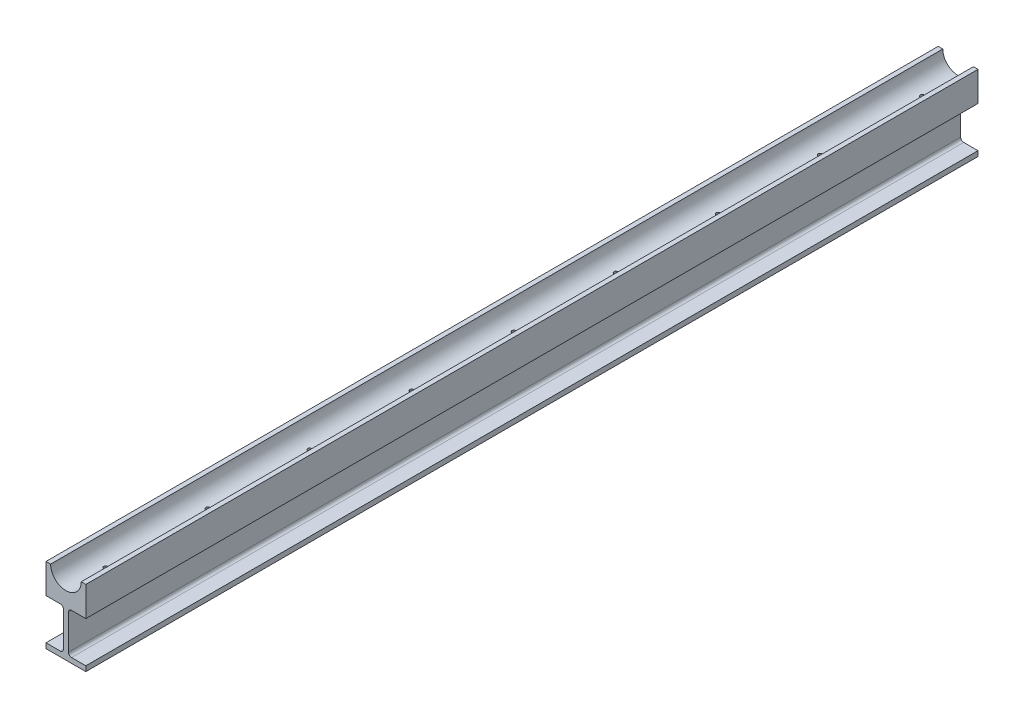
ISO-10303-21;
HEADER;
FILE_DESCRIPTION(('STEP AP214'),'2;1');
FILE_NAME('part.step','',(''),(''),'','','');
FILE_SCHEMA(('AUTOMOTIVE_DESIGN { 1 0 10303 214 1 1 1 1 }'));
ENDSEC;
DATA;
#1=APPLICATION_CONTEXT('core data for automotive mechanical design processes');
#2=APPLICATION_PROTOCOL_DEFINITION('international standard','automotive_design',2000,#1);
#3=PRODUCT_CONTEXT('',#1,'mechanical');
#4=PRODUCT('Part','Part','',(#3));
#5=PRODUCT_RELATED_PRODUCT_CATEGORY('part','',(#4));
#6=PRODUCT_DEFINITION_FORMATION('','',#4);
#7=PRODUCT_DEFINITION_CONTEXT('part definition',#1,'design');
#8=PRODUCT_DEFINITION('design','',#6,#7);
#9=PRODUCT_DEFINITION_SHAPE('','',#8);
#10=(LENGTH_UNIT() NAMED_UNIT(*) SI_UNIT(.MILLI.,.METRE.));
#11=(NAMED_UNIT(*) PLANE_ANGLE_UNIT() SI_UNIT($,.RADIAN.));
#12=(NAMED_UNIT(*) SI_UNIT($,.STERADIAN.) SOLID_ANGLE_UNIT());
#13=UNCERTAINTY_MEASURE_WITH_UNIT(LENGTH_MEASURE(1.E-05),#10,'distance_accuracy_value','');
#14=(GEOMETRIC_REPRESENTATION_CONTEXT(3) GLOBAL_UNCERTAINTY_ASSIGNED_CONTEXT((#13)) GLOBAL_UNIT_ASSIGNED_CONTEXT((#10,
#11,#12)) REPRESENTATION_CONTEXT('',''));
#15=CARTESIAN_POINT('',(0.,0.,0.));
#16=DIRECTION('',(0.,0.,1.));
#17=DIRECTION('',(1.,0.,0.));
#18=AXIS2_PLACEMENT_3D('',#15,#16,#17);
#19=CARTESIAN_POINT('',(0.,-58.,1748.));
#20=DIRECTION('',(1.,0.,0.));
#21=DIRECTION('',(0.,0.,-1.));
#22=AXIS2_PLACEMENT_3D('',#19,#20,#21);
#23=PLANE('',#22);
#24=CARTESIAN_POINT('',(0.,-36.,338.));
#25=DIRECTION('',(-1.,0.,0.));
#26=DIRECTION('',(0.,0.,1.));
#27=AXIS2_PLACEMENT_3D('',#24,#25,#26);
#28=CIRCLE('',#27,2.5);
#29=CARTESIAN_POINT('',(0.,-36.,340.5));
#30=VERTEX_POINT('',#29);
#31=EDGE_CURVE('E350',#30,#30,#28,.T.);
#32=ORIENTED_EDGE('',*,*,#31,.F.);
#33=EDGE_LOOP('',(#32));
#34=FACE_BOUND('',#33,.T.);
#35=CARTESIAN_POINT('',(0.,-36.,380.));
#36=DIRECTION('',(-1.,0.,0.));
#37=DIRECTION('',(0.,0.,1.));
#38=AXIS2_PLACEMENT_3D('',#35,#36,#37);
#39=CIRCLE('',#38,2.5);
#40=CARTESIAN_POINT('',(0.,-36.,382.5));
#41=VERTEX_POINT('',#40);
#42=EDGE_CURVE('E354',#41,#41,#39,.T.);
#43=ORIENTED_EDGE('',*,*,#42,.F.);
#44=EDGE_LOOP('',(#43));
#45=FACE_BOUND('',#44,.T.);
#46=CARTESIAN_POINT('',(0.,-36.,1374.));
#47=DIRECTION('',(-1.,0.,0.));
#48=DIRECTION('',(0.,0.,1.));
#49=AXIS2_PLACEMENT_3D('',#46,#47,#48);
#50=CIRCLE('',#49,2.5);
#51=CARTESIAN_POINT('',(0.,-36.,1376.5));
#52=VERTEX_POINT('',#51);
#53=EDGE_CURVE('E358',#52,#52,#50,.T.);
#54=ORIENTED_EDGE('',*,*,#53,.F.);
#55=EDGE_LOOP('',(#54));
#56=FACE_BOUND('',#55,.T.);
#57=CARTESIAN_POINT('',(0.,-36.,1416.));
#58=DIRECTION('',(-1.,0.,0.));
#59=DIRECTION('',(0.,0.,1.));
#60=AXIS2_PLACEMENT_3D('',#57,#58,#59);
#61=CIRCLE('',#60,2.5);
#62=CARTESIAN_POINT('',(0.,-36.,1418.5));
#63=VERTEX_POINT('',#62);
#64=EDGE_CURVE('E201',#63,#63,#61,.T.);
#65=ORIENTED_EDGE('',*,*,#64,.F.);
#66=EDGE_LOOP('',(#65));
#67=FACE_BOUND('',#66,.T.);
#68=DIRECTION('',(0.,-1.,0.));
#69=VECTOR('',#68,1.);
#70=CARTESIAN_POINT('',(0.,-58.,0.));
#71=LINE('',#70,#69);
#72=CARTESIAN_POINT('',(0.,0.,0.));
#73=VERTEX_POINT('',#72);
#74=CARTESIAN_POINT('',(0.,-58.,0.));
#75=VERTEX_POINT('',#74);
#76=EDGE_CURVE('E197',#73,#75,#71,.T.);
#77=ORIENTED_EDGE('',*,*,#76,.T.);
#78=DIRECTION('',(0.,0.,-1.));
#79=VECTOR('',#78,1.);
#80=CARTESIAN_POINT('',(0.,-58.,1748.));
#81=LINE('',#80,#79);
#82=CARTESIAN_POINT('',(0.,-58.,1748.));
#83=VERTEX_POINT('',#82);
#84=EDGE_CURVE('E11',#83,#75,#81,.T.);
#85=ORIENTED_EDGE('',*,*,#84,.F.);
#86=DIRECTION('',(0.,-1.,0.));
#87=VECTOR('',#86,1.);
#88=CARTESIAN_POINT('',(0.,-58.,1748.));
#89=LINE('',#88,#87);
#90=CARTESIAN_POINT('',(0.,0.,1748.));
#91=VERTEX_POINT('',#90);
#92=EDGE_CURVE('E232',#91,#83,#89,.T.);
#93=ORIENTED_EDGE('',*,*,#92,.F.);
#94=DIRECTION('',(0.,0.,-1.));
#95=VECTOR('',#94,1.);
#96=CARTESIAN_POINT('',(0.,0.,1748.));
#97=LINE('',#96,#95);
#98=EDGE_CURVE('E193',#91,#73,#97,.T.);
#99=ORIENTED_EDGE('',*,*,#98,.T.);
#100=EDGE_LOOP('',(#77,#85,#93,#99));
#101=FACE_BOUND('',#100,.T.);
#102=ADVANCED_FACE('F32',(#34,#45,#56,#67,#101),#23,.F.);
#103=CARTESIAN_POINT('',(28.,-58.,1748.));
#104=DIRECTION('',(0.,1.,0.));
#105=DIRECTION('',(-1.,0.,0.));
#106=AXIS2_PLACEMENT_3D('',#103,#104,#105);
#107=PLANE('',#106);
#108=DIRECTION('',(1.,0.,0.));
#109=VECTOR('',#108,1.);
#110=CARTESIAN_POINT('',(28.,-58.,0.));
#111=LINE('',#110,#109);
#112=CARTESIAN_POINT('',(28.,-58.,0.));
#113=VERTEX_POINT('',#112);
#114=EDGE_CURVE('E200',#75,#113,#111,.T.);
#115=ORIENTED_EDGE('',*,*,#114,.T.);
#116=DIRECTION('',(0.,0.,-1.));
#117=VECTOR('',#116,1.);
#118=CARTESIAN_POINT('',(28.,-58.,1748.));
#119=LINE('',#118,#117);
#120=CARTESIAN_POINT('',(28.,-58.,1748.));
#121=VERTEX_POINT('',#120);
#122=EDGE_CURVE('E45',#121,#113,#119,.T.);
#123=ORIENTED_EDGE('',*,*,#122,.F.);
#124=DIRECTION('',(1.,0.,0.));
#125=VECTOR('',#124,1.);
#126=CARTESIAN_POINT('',(28.,-58.,1748.));
#127=LINE('',#126,#125);
#128=EDGE_CURVE('E128',#83,#121,#127,.T.);
#129=ORIENTED_EDGE('',*,*,#128,.F.);
#130=ORIENTED_EDGE('',*,*,#84,.T.);
#131=EDGE_LOOP('',(#115,#123,#129,#130));
#132=FACE_BOUND('',#131,.T.);
#133=ADVANCED_FACE('F341',(#132),#107,.F.);
#134=CARTESIAN_POINT('',(28.,-63.9999999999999,1748.));
#135=DIRECTION('',(0.,0.,-1.));
#136=DIRECTION('',(-1.,0.,0.));
#137=AXIS2_PLACEMENT_3D('',#134,#135,#136);
#138=CYLINDRICAL_SURFACE('',#137,6.);
#139=CARTESIAN_POINT('',(28.,-63.9999999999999,0.));
#140=DIRECTION('',(0.,0.,-1.));
#141=DIRECTION('',(1.,0.,0.));
#142=AXIS2_PLACEMENT_3D('',#139,#140,#141);
#143=CIRCLE('',#142,6.);
#144=CARTESIAN_POINT('',(34.,-64.,0.));
#145=VERTEX_POINT('',#144);
#146=EDGE_CURVE('E203',#113,#145,#143,.T.);
#147=ORIENTED_EDGE('',*,*,#146,.T.);
#148=DIRECTION('',(0.,0.,-1.));
#149=VECTOR('',#148,1.);
#150=CARTESIAN_POINT('',(34.,-64.,1748.));
#151=LINE('',#150,#149);
#152=CARTESIAN_POINT('',(34.,-64.,1748.));
#153=VERTEX_POINT('',#152);
#154=EDGE_CURVE('E269',#153,#145,#151,.T.);
#155=ORIENTED_EDGE('',*,*,#154,.F.);
#156=CARTESIAN_POINT('',(28.,-63.9999999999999,1748.));
#157=DIRECTION('',(0.,0.,-1.));
#158=DIRECTION('',(1.,0.,0.));
#159=AXIS2_PLACEMENT_3D('',#156,#157,#158);
#160=CIRCLE('',#159,6.);
#161=EDGE_CURVE('E370',#121,#153,#160,.T.);
#162=ORIENTED_EDGE('',*,*,#161,.F.);
#163=ORIENTED_EDGE('',*,*,#122,.T.);
#164=EDGE_LOOP('',(#147,#155,#162,#163));
#165=FACE_BOUND('',#164,.T.);
#166=ADVANCED_FACE('F346',(#165),#138,.F.);
#167=CARTESIAN_POINT('',(34.,-132.,1748.));
#168=DIRECTION('',(1.,0.,0.));
#169=DIRECTION('',(0.,0.,-1.));
#170=AXIS2_PLACEMENT_3D('',#167,#168,#169);
#171=PLANE('',#170);
#172=DIRECTION('',(0.,-1.,0.));
#173=VECTOR('',#172,1.);
#174=CARTESIAN_POINT('',(34.,-132.,0.));
#175=LINE('',#174,#173);
#176=CARTESIAN_POINT('',(34.,-132.,0.));
#177=VERTEX_POINT('',#176);
#178=EDGE_CURVE('E205',#145,#177,#175,.T.);
#179=ORIENTED_EDGE('',*,*,#178,.T.);
#180=DIRECTION('',(0.,0.,-1.));
#181=VECTOR('',#180,1.);
#182=CARTESIAN_POINT('',(34.,-132.,1748.));
#183=LINE('',#182,#181);
#184=CARTESIAN_POINT('',(34.,-132.,1748.));
#185=VERTEX_POINT('',#184);
#186=EDGE_CURVE('E266',#185,#177,#183,.T.);
#187=ORIENTED_EDGE('',*,*,#186,.F.);
#188=DIRECTION('',(0.,-1.,0.));
#189=VECTOR('',#188,1.);
#190=CARTESIAN_POINT('',(34.,-132.,1748.));
#191=LINE('',#190,#189);
#192=EDGE_CURVE('E372',#153,#185,#191,.T.);
#193=ORIENTED_EDGE('',*,*,#192,.F.);
#194=ORIENTED_EDGE('',*,*,#154,.T.);
#195=EDGE_LOOP('',(#179,#187,#193,#194));
#196=FACE_BOUND('',#195,.T.);
#197=ADVANCED_FACE('F452',(#196),#171,.F.);
#198=CARTESIAN_POINT('',(28.,-132.,1748.));
#199=DIRECTION('',(0.,0.,-1.));
#200=DIRECTION('',(-1.,0.,0.));
#201=AXIS2_PLACEMENT_3D('',#198,#199,#200);
#202=CYLINDRICAL_SURFACE('',#201,6.);
#203=CARTESIAN_POINT('',(28.,-132.,0.));
#204=DIRECTION('',(0.,0.,-1.));
#205=DIRECTION('',(1.,0.,0.));
#206=AXIS2_PLACEMENT_3D('',#203,#204,#205);
#207=CIRCLE('',#206,6.);
#208=CARTESIAN_POINT('',(28.,-138.,0.));
#209=VERTEX_POINT('',#208);
#210=EDGE_CURVE('E207',#177,#209,#207,.T.);
#211=ORIENTED_EDGE('',*,*,#210,.T.);
#212=DIRECTION('',(0.,0.,-1.));
#213=VECTOR('',#212,1.);
#214=CARTESIAN_POINT('',(28.,-138.,1748.));
#215=LINE('',#214,#213);
#216=CARTESIAN_POINT('',(28.,-138.,1748.));
#217=VERTEX_POINT('',#216);
#218=EDGE_CURVE('E263',#217,#209,#215,.T.);
#219=ORIENTED_EDGE('',*,*,#218,.F.);
#220=CARTESIAN_POINT('',(28.,-132.,1748.));
#221=DIRECTION('',(0.,0.,-1.));
#222=DIRECTION('',(1.,0.,0.));
#223=AXIS2_PLACEMENT_3D('',#220,#221,#222);
#224=CIRCLE('',#223,6.);
#225=EDGE_CURVE('E374',#185,#217,#224,.T.);
#226=ORIENTED_EDGE('',*,*,#225,.F.);
#227=ORIENTED_EDGE('',*,*,#186,.T.);
#228=EDGE_LOOP('',(#211,#219,#226,#227));
#229=FACE_BOUND('',#228,.T.);
#230=ADVANCED_FACE('F449',(#229),#202,.F.);
#231=CARTESIAN_POINT('',(0.,-138.,1748.));
#232=DIRECTION('',(0.,-1.,0.));
#233=DIRECTION('',(0.,0.,-1.));
#234=AXIS2_PLACEMENT_3D('',#231,#232,#233);
#235=PLANE('',#234);
#236=DIRECTION('',(-1.,0.,0.));
#237=VECTOR('',#236,1.);
#238=CARTESIAN_POINT('',(0.,-138.,0.));
#239=LINE('',#238,#237);
#240=CARTESIAN_POINT('',(0.,-138.,0.));
#241=VERTEX_POINT('',#240);
#242=EDGE_CURVE('E209',#209,#241,#239,.T.);
#243=ORIENTED_EDGE('',*,*,#242,.T.);
#244=DIRECTION('',(0.,0.,-1.));
#245=VECTOR('',#244,1.);
#246=CARTESIAN_POINT('',(0.,-138.,1748.));
#247=LINE('',#246,#245);
#248=CARTESIAN_POINT('',(0.,-138.,1748.));
#249=VERTEX_POINT('',#248);
#250=EDGE_CURVE('E260',#249,#241,#247,.T.);
#251=ORIENTED_EDGE('',*,*,#250,.F.);
#252=DIRECTION('',(-1.,0.,0.));
#253=VECTOR('',#252,1.);
#254=CARTESIAN_POINT('',(0.,-138.,1748.));
#255=LINE('',#254,#253);
#256=EDGE_CURVE('E380',#217,#249,#255,.T.);
#257=ORIENTED_EDGE('',*,*,#256,.F.);
#258=ORIENTED_EDGE('',*,*,#218,.T.);
#259=EDGE_LOOP('',(#243,#251,#257,#258));
#260=FACE_BOUND('',#259,.T.);
#261=ADVANCED_FACE('F445',(#260),#235,.F.);
#262=CARTESIAN_POINT('',(0.,-148.,1748.));
#263=DIRECTION('',(1.,0.,0.));
#264=DIRECTION('',(0.,0.,-1.));
#265=AXIS2_PLACEMENT_3D('',#262,#263,#264);
#266=PLANE('',#265);
#267=DIRECTION('',(0.,-1.,0.));
#268=VECTOR('',#267,1.);
#269=CARTESIAN_POINT('',(0.,-148.,0.));
#270=LINE('',#269,#268);
#271=CARTESIAN_POINT('',(0.,-148.,0.));
#272=VERTEX_POINT('',#271);
#273=EDGE_CURVE('E211',#241,#272,#270,.T.);
#274=ORIENTED_EDGE('',*,*,#273,.T.);
#275=DIRECTION('',(0.,0.,-1.));
#276=VECTOR('',#275,1.);
#277=CARTESIAN_POINT('',(0.,-148.,1748.));
#278=LINE('',#277,#276);
#279=CARTESIAN_POINT('',(0.,-148.,1748.));
#280=VERTEX_POINT('',#279);
#281=EDGE_CURVE('E257',#280,#272,#278,.T.);
#282=ORIENTED_EDGE('',*,*,#281,.F.);
#283=DIRECTION('',(0.,-1.,0.));
#284=VECTOR('',#283,1.);
#285=CARTESIAN_POINT('',(0.,-148.,1748.));
#286=LINE('',#285,#284);
#287=EDGE_CURVE('E382',#249,#280,#286,.T.);
#288=ORIENTED_EDGE('',*,*,#287,.F.);
#289=ORIENTED_EDGE('',*,*,#250,.T.);
#290=EDGE_LOOP('',(#274,#282,#288,#289));
#291=FACE_BOUND('',#290,.T.);
#292=ADVANCED_FACE('F440',(#291),#266,.F.);
#293=CARTESIAN_POINT('',(78.,-148.,1748.));
#294=DIRECTION('',(0.,1.,0.));
#295=DIRECTION('',(0.,0.,1.));
#296=AXIS2_PLACEMENT_3D('',#293,#294,#295);
#297=PLANE('',#296);
#298=DIRECTION('',(1.,0.,0.));
#299=VECTOR('',#298,1.);
#300=CARTESIAN_POINT('',(78.,-148.,0.));
#301=LINE('',#300,#299);
#302=CARTESIAN_POINT('',(78.,-148.,0.));
#303=VERTEX_POINT('',#302);
#304=EDGE_CURVE('E213',#272,#303,#301,.T.);
#305=ORIENTED_EDGE('',*,*,#304,.T.);
#306=DIRECTION('',(0.,0.,-1.));
#307=VECTOR('',#306,1.);
#308=CARTESIAN_POINT('',(78.,-148.,1748.));
#309=LINE('',#308,#307);
#310=CARTESIAN_POINT('',(78.,-148.,1748.));
#311=VERTEX_POINT('',#310);
#312=EDGE_CURVE('E254',#311,#303,#309,.T.);
#313=ORIENTED_EDGE('',*,*,#312,.F.);
#314=DIRECTION('',(1.,0.,0.));
#315=VECTOR('',#314,1.);
#316=CARTESIAN_POINT('',(78.,-148.,1748.));
#317=LINE('',#316,#315);
#318=EDGE_CURVE('E384',#280,#311,#317,.T.);
#319=ORIENTED_EDGE('',*,*,#318,.F.);
#320=ORIENTED_EDGE('',*,*,#281,.T.);
#321=EDGE_LOOP('',(#305,#313,#319,#320));
#322=FACE_BOUND('',#321,.T.);
#323=ADVANCED_FACE('F434',(#322),#297,.F.);
#324=CARTESIAN_POINT('',(78.,-138.,1748.));
#325=DIRECTION('',(-1.,0.,0.));
#326=DIRECTION('',(0.,-1.,0.));
#327=AXIS2_PLACEMENT_3D('',#324,#325,#326);
#328=PLANE('',#327);
#329=DIRECTION('',(0.,1.,0.));
#330=VECTOR('',#329,1.);
#331=CARTESIAN_POINT('',(78.,-138.,0.));
#332=LINE('',#331,#330);
#333=CARTESIAN_POINT('',(78.,-138.,0.));
#334=VERTEX_POINT('',#333);
#335=EDGE_CURVE('E215',#303,#334,#332,.T.);
#336=ORIENTED_EDGE('',*,*,#335,.T.);
#337=DIRECTION('',(0.,0.,-1.));
#338=VECTOR('',#337,1.);
#339=CARTESIAN_POINT('',(78.,-138.,1748.));
#340=LINE('',#339,#338);
#341=CARTESIAN_POINT('',(78.,-138.,1748.));
#342=VERTEX_POINT('',#341);
#343=EDGE_CURVE('E251',#342,#334,#340,.T.);
#344=ORIENTED_EDGE('',*,*,#343,.F.);
#345=DIRECTION('',(0.,1.,0.));
#346=VECTOR('',#345,1.);
#347=CARTESIAN_POINT('',(78.,-138.,1748.));
#348=LINE('',#347,#346);
#349=EDGE_CURVE('E386',#311,#342,#348,.T.);
#350=ORIENTED_EDGE('',*,*,#349,.F.);
#351=ORIENTED_EDGE('',*,*,#312,.T.);
#352=EDGE_LOOP('',(#336,#344,#350,#351));
#353=FACE_BOUND('',#352,.T.);
#354=ADVANCED_FACE('F430',(#353),#328,.F.);
#355=CARTESIAN_POINT('',(50.0000000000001,-138.,1748.));
#356=DIRECTION('',(0.,-1.,0.));
#357=DIRECTION('',(0.,0.,-1.));
#358=AXIS2_PLACEMENT_3D('',#355,#356,#357);
#359=PLANE('',#358);
#360=DIRECTION('',(-1.,0.,0.));
#361=VECTOR('',#360,1.);
#362=CARTESIAN_POINT('',(50.0000000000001,-138.,0.));
#363=LINE('',#362,#361);
#364=CARTESIAN_POINT('',(50.0000000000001,-138.,0.));
#365=VERTEX_POINT('',#364);
#366=EDGE_CURVE('E217',#334,#365,#363,.T.);
#367=ORIENTED_EDGE('',*,*,#366,.T.);
#368=DIRECTION('',(0.,0.,-1.));
#369=VECTOR('',#368,1.);
#370=CARTESIAN_POINT('',(50.0000000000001,-138.,1748.));
#371=LINE('',#370,#369);
#372=CARTESIAN_POINT('',(50.0000000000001,-138.,1748.));
#373=VERTEX_POINT('',#372);
#374=EDGE_CURVE('E248',#373,#365,#371,.T.);
#375=ORIENTED_EDGE('',*,*,#374,.F.);
#376=DIRECTION('',(-1.,0.,0.));
#377=VECTOR('',#376,1.);
#378=CARTESIAN_POINT('',(50.0000000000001,-138.,1748.));
#379=LINE('',#378,#377);
#380=EDGE_CURVE('E388',#342,#373,#379,.T.);
#381=ORIENTED_EDGE('',*,*,#380,.F.);
#382=ORIENTED_EDGE('',*,*,#343,.T.);
#383=EDGE_LOOP('',(#367,#375,#381,#382));
#384=FACE_BOUND('',#383,.T.);
#385=ADVANCED_FACE('F425',(#384),#359,.F.);
#386=CARTESIAN_POINT('',(50.,-132.,1748.));
#387=DIRECTION('',(0.,0.,-1.));
#388=DIRECTION('',(-1.,0.,0.));
#389=AXIS2_PLACEMENT_3D('',#386,#387,#388);
#390=CYLINDRICAL_SURFACE('',#389,6.);
#391=CARTESIAN_POINT('',(50.,-132.,0.));
#392=DIRECTION('',(0.,0.,-1.));
#393=DIRECTION('',(1.,0.,0.));
#394=AXIS2_PLACEMENT_3D('',#391,#392,#393);
#395=CIRCLE('',#394,6.);
#396=CARTESIAN_POINT('',(44.,-132.,0.));
#397=VERTEX_POINT('',#396);
#398=EDGE_CURVE('E219',#365,#397,#395,.T.);
#399=ORIENTED_EDGE('',*,*,#398,.T.);
#400=DIRECTION('',(0.,0.,-1.));
#401=VECTOR('',#400,1.);
#402=CARTESIAN_POINT('',(44.,-132.,1748.));
#403=LINE('',#402,#401);
#404=CARTESIAN_POINT('',(44.,-132.,1748.));
#405=VERTEX_POINT('',#404);
#406=EDGE_CURVE('E245',#405,#397,#403,.T.);
#407=ORIENTED_EDGE('',*,*,#406,.F.);
#408=CARTESIAN_POINT('',(50.,-132.,1748.));
#409=DIRECTION('',(0.,0.,-1.));
#410=DIRECTION('',(1.,0.,0.));
#411=AXIS2_PLACEMENT_3D('',#408,#409,#410);
#412=CIRCLE('',#411,6.);
#413=EDGE_CURVE('E390',#373,#405,#412,.T.);
#414=ORIENTED_EDGE('',*,*,#413,.F.);
#415=ORIENTED_EDGE('',*,*,#374,.T.);
#416=EDGE_LOOP('',(#399,#407,#414,#415));
#417=FACE_BOUND('',#416,.T.);
#418=ADVANCED_FACE('F419',(#417),#390,.F.);
#419=CARTESIAN_POINT('',(44.,-64.0000000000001,1748.));
#420=DIRECTION('',(-1.,0.,0.));
#421=DIRECTION('',(0.,0.,1.));
#422=AXIS2_PLACEMENT_3D('',#419,#420,#421);
#423=PLANE('',#422);
#424=DIRECTION('',(0.,1.,0.));
#425=VECTOR('',#424,1.);
#426=CARTESIAN_POINT('',(44.,-64.0000000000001,0.));
#427=LINE('',#426,#425);
#428=CARTESIAN_POINT('',(44.,-64.0000000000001,0.));
#429=VERTEX_POINT('',#428);
#430=EDGE_CURVE('E221',#397,#429,#427,.T.);
#431=ORIENTED_EDGE('',*,*,#430,.T.);
#432=DIRECTION('',(0.,0.,-1.));
#433=VECTOR('',#432,1.);
#434=CARTESIAN_POINT('',(44.,-64.0000000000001,1748.));
#435=LINE('',#434,#433);
#436=CARTESIAN_POINT('',(44.,-64.0000000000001,1748.));
#437=VERTEX_POINT('',#436);
#438=EDGE_CURVE('E242',#437,#429,#435,.T.);
#439=ORIENTED_EDGE('',*,*,#438,.F.);
#440=DIRECTION('',(0.,1.,0.));
#441=VECTOR('',#440,1.);
#442=CARTESIAN_POINT('',(44.,-64.0000000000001,1748.));
#443=LINE('',#442,#441);
#444=EDGE_CURVE('E392',#405,#437,#443,.T.);
#445=ORIENTED_EDGE('',*,*,#444,.F.);
#446=ORIENTED_EDGE('',*,*,#406,.T.);
#447=EDGE_LOOP('',(#431,#439,#445,#446));
#448=FACE_BOUND('',#447,.T.);
#449=ADVANCED_FACE('F415',(#448),#423,.F.);
#450=CARTESIAN_POINT('',(50.,-64.,1748.));
#451=DIRECTION('',(0.,0.,-1.));
#452=DIRECTION('',(-1.,0.,0.));
#453=AXIS2_PLACEMENT_3D('',#450,#451,#452);
#454=CYLINDRICAL_SURFACE('',#453,6.);
#455=CARTESIAN_POINT('',(50.,-64.,0.));
#456=DIRECTION('',(0.,0.,-1.));
#457=DIRECTION('',(1.,0.,0.));
#458=AXIS2_PLACEMENT_3D('',#455,#456,#457);
#459=CIRCLE('',#458,6.);
#460=CARTESIAN_POINT('',(50.0000000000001,-58.,0.));
#461=VERTEX_POINT('',#460);
#462=EDGE_CURVE('E223',#429,#461,#459,.T.);
#463=ORIENTED_EDGE('',*,*,#462,.T.);
#464=DIRECTION('',(0.,0.,-1.));
#465=VECTOR('',#464,1.);
#466=CARTESIAN_POINT('',(50.0000000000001,-58.,1748.));
#467=LINE('',#466,#465);
#468=CARTESIAN_POINT('',(50.0000000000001,-58.,1748.));
#469=VERTEX_POINT('',#468);
#470=EDGE_CURVE('E239',#469,#461,#467,.T.);
#471=ORIENTED_EDGE('',*,*,#470,.F.);
#472=CARTESIAN_POINT('',(50.,-64.,1748.));
#473=DIRECTION('',(0.,0.,-1.));
#474=DIRECTION('',(1.,0.,0.));
#475=AXIS2_PLACEMENT_3D('',#472,#473,#474);
#476=CIRCLE('',#475,6.);
#477=EDGE_CURVE('E394',#437,#469,#476,.T.);
#478=ORIENTED_EDGE('',*,*,#477,.F.);
#479=ORIENTED_EDGE('',*,*,#438,.T.);
#480=EDGE_LOOP('',(#463,#471,#478,#479));
#481=FACE_BOUND('',#480,.T.);
#482=ADVANCED_FACE('F411',(#481),#454,.F.);
#483=CARTESIAN_POINT('',(78.,-58.,1748.));
#484=DIRECTION('',(0.,1.,0.));
#485=DIRECTION('',(-1.,0.,0.));
#486=AXIS2_PLACEMENT_3D('',#483,#484,#485);
#487=PLANE('',#486);
#488=DIRECTION('',(1.,0.,0.));
#489=VECTOR('',#488,1.);
#490=CARTESIAN_POINT('',(78.,-58.,0.));
#491=LINE('',#490,#489);
#492=CARTESIAN_POINT('',(78.,-58.,0.));
#493=VERTEX_POINT('',#492);
#494=EDGE_CURVE('E225',#461,#493,#491,.T.);
#495=ORIENTED_EDGE('',*,*,#494,.T.);
#496=DIRECTION('',(0.,0.,-1.));
#497=VECTOR('',#496,1.);
#498=CARTESIAN_POINT('',(78.,-58.,1748.));
#499=LINE('',#498,#497);
#500=CARTESIAN_POINT('',(78.,-58.,1748.));
#501=VERTEX_POINT('',#500);
#502=EDGE_CURVE('E236',#501,#493,#499,.T.);
#503=ORIENTED_EDGE('',*,*,#502,.F.);
#504=DIRECTION('',(1.,0.,0.));
#505=VECTOR('',#504,1.);
#506=CARTESIAN_POINT('',(78.,-58.,1748.));
#507=LINE('',#506,#505);
#508=EDGE_CURVE('E396',#469,#501,#507,.T.);
#509=ORIENTED_EDGE('',*,*,#508,.F.);
#510=ORIENTED_EDGE('',*,*,#470,.T.);
#511=EDGE_LOOP('',(#495,#503,#509,#510));
#512=FACE_BOUND('',#511,.T.);
#513=ADVANCED_FACE('F402',(#512),#487,.F.);
#514=CARTESIAN_POINT('',(78.,0.,1748.));
#515=DIRECTION('',(-1.,0.,0.));
#516=DIRECTION('',(0.,-1.,0.));
#517=AXIS2_PLACEMENT_3D('',#514,#515,#516);
#518=PLANE('',#517);
#519=DIRECTION('',(0.,1.,0.));
#520=VECTOR('',#519,1.);
#521=CARTESIAN_POINT('',(78.,0.,0.));
#522=LINE('',#521,#520);
#523=CARTESIAN_POINT('',(78.,0.,0.));
#524=VERTEX_POINT('',#523);
#525=EDGE_CURVE('E227',#493,#524,#522,.T.);
#526=ORIENTED_EDGE('',*,*,#525,.T.);
#527=DIRECTION('',(0.,0.,-1.));
#528=VECTOR('',#527,1.);
#529=CARTESIAN_POINT('',(78.,0.,1748.));
#530=LINE('',#529,#528);
#531=CARTESIAN_POINT('',(78.,0.,1748.));
#532=VERTEX_POINT('',#531);
#533=EDGE_CURVE('E188',#532,#524,#530,.T.);
#534=ORIENTED_EDGE('',*,*,#533,.F.);
#535=DIRECTION('',(0.,1.,0.));
#536=VECTOR('',#535,1.);
#537=CARTESIAN_POINT('',(78.,0.,1748.));
#538=LINE('',#537,#536);
#539=EDGE_CURVE('E179',#501,#532,#538,.T.);
#540=ORIENTED_EDGE('',*,*,#539,.F.);
#541=ORIENTED_EDGE('',*,*,#502,.T.);
#542=EDGE_LOOP('',(#526,#534,#540,#541));
#543=FACE_BOUND('',#542,.T.);
#544=ADVANCED_FACE('F406',(#543),#518,.F.);
#545=CARTESIAN_POINT('',(69.,0.,1748.));
#546=DIRECTION('',(0.,-1.,0.));
#547=DIRECTION('',(0.,0.,-1.));
#548=AXIS2_PLACEMENT_3D('',#545,#546,#547);
#549=PLANE('',#548);
#550=DIRECTION('',(-1.,0.,0.));
#551=VECTOR('',#550,1.);
#552=CARTESIAN_POINT('',(69.,0.,0.));
#553=LINE('',#552,#551);
#554=CARTESIAN_POINT('',(69.,0.,0.));
#555=VERTEX_POINT('',#554);
#556=EDGE_CURVE('E187',#524,#555,#553,.T.);
#557=ORIENTED_EDGE('',*,*,#556,.T.);
#558=DIRECTION('',(0.,0.,-1.));
#559=VECTOR('',#558,1.);
#560=CARTESIAN_POINT('',(69.,0.,1748.));
#561=LINE('',#560,#559);
#562=CARTESIAN_POINT('',(69.,0.,1748.));
#563=VERTEX_POINT('',#562);
#564=EDGE_CURVE('E184',#563,#555,#561,.T.);
#565=ORIENTED_EDGE('',*,*,#564,.F.);
#566=DIRECTION('',(-1.,0.,0.));
#567=VECTOR('',#566,1.);
#568=CARTESIAN_POINT('',(69.,0.,1748.));
#569=LINE('',#568,#567);
#570=EDGE_CURVE('E173',#532,#563,#569,.T.);
#571=ORIENTED_EDGE('',*,*,#570,.F.);
#572=ORIENTED_EDGE('',*,*,#533,.T.);
#573=EDGE_LOOP('',(#557,#565,#571,#572));
#574=FACE_BOUND('',#573,.T.);
#575=ADVANCED_FACE('F185',(#574),#549,.F.);
#576=CARTESIAN_POINT('',(39.,0.,1748.));
#577=DIRECTION('',(0.,0.,-1.));
#578=DIRECTION('',(-1.,0.,0.));
#579=AXIS2_PLACEMENT_3D('',#576,#577,#578);
#580=CYLINDRICAL_SURFACE('',#579,30.);
#581=CARTESIAN_POINT('',(39.,-30.,1674.));
#582=CARTESIAN_POINT('',(38.7763823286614,-29.9999967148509,1673.99999058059));
#583=CARTESIAN_POINT('',(38.5526280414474,-29.9974734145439,1673.98118492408));
#584=CARTESIAN_POINT('',(38.1113545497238,-29.9876502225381,1673.9064673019));
#585=CARTESIAN_POINT('',(37.8938419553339,-29.9803454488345,1673.85051741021));
#586=CARTESIAN_POINT('',(37.471503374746,-29.9617815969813,1673.70319656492));
#587=CARTESIAN_POINT('',(37.266668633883,-29.9505252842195,1673.61185037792));
#588=CARTESIAN_POINT('',(36.8752722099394,-29.9253077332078,1673.39638617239));
#589=CARTESIAN_POINT('',(36.688707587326,-29.9113469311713,1673.27227343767));
#590=CARTESIAN_POINT('',(36.3379483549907,-29.8821798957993,1672.99397347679));
#591=CARTESIAN_POINT('',(36.1738840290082,-29.8669671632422,1672.83962270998));
#592=CARTESIAN_POINT('',(35.8739052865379,-29.837062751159,1672.50557962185));
#593=CARTESIAN_POINT('',(35.7379923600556,-29.8223710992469,1672.32588596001));
#594=CARTESIAN_POINT('',(35.4976819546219,-29.7951087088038,1671.94540175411));
#595=CARTESIAN_POINT('',(35.3934078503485,-29.7825463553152,1671.74453263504));
#596=CARTESIAN_POINT('',(35.2201230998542,-29.7610517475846,1671.32793786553));
#597=CARTESIAN_POINT('',(35.1511109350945,-29.7521193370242,1671.11221285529));
#598=CARTESIAN_POINT('',(35.0507078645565,-29.7389587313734,1670.673388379));
#599=CARTESIAN_POINT('',(35.0190959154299,-29.7347029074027,1670.45034033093));
#600=CARTESIAN_POINT('',(34.9937063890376,-29.7312930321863,1670.00206764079));
#601=CARTESIAN_POINT('',(34.999927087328,-29.732138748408,1669.77684309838));
#602=CARTESIAN_POINT('',(35.0498450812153,-29.7388111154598,1669.33215773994));
#603=CARTESIAN_POINT('',(35.0932980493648,-29.7446052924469,1669.11266894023));
#604=CARTESIAN_POINT('',(35.2160655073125,-29.7604710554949,1668.68412632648));
#605=CARTESIAN_POINT('',(35.2953808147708,-29.7705427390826,1668.47507275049));
#606=CARTESIAN_POINT('',(35.4878814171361,-29.7938652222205,1668.07258073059));
#607=CARTESIAN_POINT('',(35.601172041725,-29.807125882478,1667.87919325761));
#608=CARTESIAN_POINT('',(35.8583321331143,-29.8353247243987,1667.51408183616));
#609=CARTESIAN_POINT('',(36.0022031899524,-29.8502629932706,1667.34235901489));
#610=CARTESIAN_POINT('',(36.3177901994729,-29.8802779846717,1667.02403397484));
#611=CARTESIAN_POINT('',(36.4897165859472,-29.895354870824,1666.8776403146));
#612=CARTESIAN_POINT('',(36.8558116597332,-29.9238384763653,1666.61575591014));
#613=CARTESIAN_POINT('',(37.0499804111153,-29.9372451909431,1666.50026525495));
#614=CARTESIAN_POINT('',(37.455215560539,-29.9608878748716,1666.30346176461));
#615=CARTESIAN_POINT('',(37.6662888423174,-29.9711225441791,1666.22216293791));
#616=CARTESIAN_POINT('',(38.0992581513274,-29.9872565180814,1666.09622136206));
#617=CARTESIAN_POINT('',(38.3211536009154,-29.9931560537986,1666.05157665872));
#618=CARTESIAN_POINT('',(38.7676661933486,-29.9999248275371,1666.00048313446));
#619=CARTESIAN_POINT('',(38.9922499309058,-30.0008318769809,1665.99374719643));
#620=CARTESIAN_POINT('',(39.4393432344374,-29.9976158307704,1666.01790332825));
#621=CARTESIAN_POINT('',(39.6618528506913,-29.993492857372,1666.04879448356));
#622=CARTESIAN_POINT('',(40.0976274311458,-29.980703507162,1666.14708930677));
#623=CARTESIAN_POINT('',(40.3109240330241,-29.9720542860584,1666.21435513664));
#624=CARTESIAN_POINT('',(40.7232101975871,-29.9511801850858,1666.38334593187));
#625=CARTESIAN_POINT('',(40.9221992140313,-29.9389551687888,1666.48507221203));
#626=CARTESIAN_POINT('',(41.3014977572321,-29.9121967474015,1666.72078431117));
#627=CARTESIAN_POINT('',(41.4816916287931,-29.8976503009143,1666.85495473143));
#628=CARTESIAN_POINT('',(41.8171058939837,-29.8679145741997,1667.15148665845));
#629=CARTESIAN_POINT('',(41.9723251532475,-29.8527252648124,1667.31384944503));
#630=CARTESIAN_POINT('',(42.2544109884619,-29.8232980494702,1667.66342628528));
#631=CARTESIAN_POINT('',(42.3810865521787,-29.809066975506,1667.85079513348));
#632=CARTESIAN_POINT('',(42.6011670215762,-29.7832826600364,1668.24431882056));
#633=CARTESIAN_POINT('',(42.6945726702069,-29.7717293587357,1668.45047323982));
#634=CARTESIAN_POINT('',(42.845156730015,-29.7526562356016,1668.87511448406));
#635=CARTESIAN_POINT('',(42.902440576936,-29.7451246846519,1669.09356337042));
#636=CARTESIAN_POINT('',(42.9794933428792,-29.7349149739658,1669.53708726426));
#637=CARTESIAN_POINT('',(42.9992642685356,-29.7322365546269,1669.76216191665));
#638=CARTESIAN_POINT('',(43.0006897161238,-29.732044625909,1670.21064698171));
#639=CARTESIAN_POINT('',(42.9826443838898,-29.7344904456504,1670.43405648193));
#640=CARTESIAN_POINT('',(42.9095875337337,-29.744183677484,1670.87463575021));
#641=CARTESIAN_POINT('',(42.8545760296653,-29.7514310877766,1671.0918055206));
#642=CARTESIAN_POINT('',(42.7092462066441,-29.7698978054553,1671.5136873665));
#643=CARTESIAN_POINT('',(42.6189444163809,-29.781115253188,1671.71840522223));
#644=CARTESIAN_POINT('',(42.4056268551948,-29.8062609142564,1672.10983176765));
#645=CARTESIAN_POINT('',(42.2826104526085,-29.8201891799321,1672.29654010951));
#646=CARTESIAN_POINT('',(42.0062489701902,-29.8493193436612,1672.64817929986));
#647=CARTESIAN_POINT('',(41.8526805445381,-29.8645301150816,1672.81293389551));
#648=CARTESIAN_POINT('',(41.5200433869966,-29.8944343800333,1673.11444643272));
#649=CARTESIAN_POINT('',(41.3409686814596,-29.9091277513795,1673.2511977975));
#650=CARTESIAN_POINT('',(40.9615059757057,-29.9364127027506,1673.49333427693));
#651=CARTESIAN_POINT('',(40.761029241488,-29.9489949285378,1673.59858133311));
#652=CARTESIAN_POINT('',(40.3451848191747,-29.9705464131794,1673.77376119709));
#653=CARTESIAN_POINT('',(40.1298333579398,-29.9795195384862,1673.84373181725));
#654=CARTESIAN_POINT('',(39.7611768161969,-29.9907144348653,1673.92989601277));
#655=CARTESIAN_POINT('',(39.6101821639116,-29.9941792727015,1673.95614648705));
#656=CARTESIAN_POINT('',(39.3061463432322,-29.9988231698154,1673.99120162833));
#657=CARTESIAN_POINT('',(39.1531051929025,-30.000002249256,1674.00000644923));
#658=CARTESIAN_POINT('',(39.,-30.,1674.));
#659=B_SPLINE_CURVE_WITH_KNOTS('',3,(#581,#582,#583,#584,#585,#586,#587,#588,#589,#590,#591,
#592,#593,#594,#595,#596,#597,#598,#599,#600,#601,#602,#603,#604,#605,#606,#607,#608,#609,#610,
#611,#612,#613,#614,#615,#616,#617,#618,#619,#620,#621,#622,#623,#624,#625,#626,#627,#628,#629,
#630,#631,#632,#633,#634,#635,#636,#637,#638,#639,#640,#641,#642,#643,#644,#645,#646,#647,#648,
#649,#650,#651,#652,#653,#654,#655,#656,#657,#658),.UNSPECIFIED.,.T.,.F.,(4,2,2,2,2,2,2,2,2,2,2,
2,2,2,2,2,2,2,2,2,2,2,2,2,2,2,2,2,2,2,2,2,2,2,2,2,2,2,4),(0.,0.670293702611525,1.34127286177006,
2.01178338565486,2.68218585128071,3.35631956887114,4.03048895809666,4.70725443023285,
5.38399075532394,6.05670711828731,6.72939281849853,7.39769770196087,8.06601782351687,
8.73643166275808,9.40688036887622,10.0826108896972,10.7583433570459,11.4343524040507,
12.1103254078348,12.7811716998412,13.4520016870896,14.1203072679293,14.788638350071,
15.4608654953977,16.1331231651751,16.8097540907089,17.4863699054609,18.1610014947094,
18.8355969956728,19.5048585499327,20.174119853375,20.8430680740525,21.5120292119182,
22.1860733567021,22.8602756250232,23.5373905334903,24.2137780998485,24.6727147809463,
25.1316474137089),.UNSPECIFIED.);
#660=CARTESIAN_POINT('',(39.,-30.,1674.));
#661=VERTEX_POINT('',#660);
#662=EDGE_CURVE('E35',#661,#661,#659,.T.);
#663=ORIENTED_EDGE('',*,*,#662,.T.);
#664=EDGE_LOOP('',(#663));
#665=FACE_BOUND('',#664,.T.);
#666=CARTESIAN_POINT('',(39.,-30.,1474.));
#667=CARTESIAN_POINT('',(38.7763823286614,-29.9999967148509,1473.99999058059));
#668=CARTESIAN_POINT('',(38.5526280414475,-29.9974734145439,1473.98118492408));
#669=CARTESIAN_POINT('',(38.1113545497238,-29.9876502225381,1473.9064673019));
#670=CARTESIAN_POINT('',(37.8938419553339,-29.9803454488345,1473.85051741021));
#671=CARTESIAN_POINT('',(37.471503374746,-29.9617815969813,1473.70319656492));
#672=CARTESIAN_POINT('',(37.266668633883,-29.9505252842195,1473.61185037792));
#673=CARTESIAN_POINT('',(36.8752722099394,-29.9253077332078,1473.39638617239));
#674=CARTESIAN_POINT('',(36.688707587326,-29.9113469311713,1473.27227343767));
#675=CARTESIAN_POINT('',(36.3379483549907,-29.8821798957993,1472.99397347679));
#676=CARTESIAN_POINT('',(36.1738840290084,-29.8669671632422,1472.83962270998));
#677=CARTESIAN_POINT('',(35.8739052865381,-29.837062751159,1472.50557962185));
#678=CARTESIAN_POINT('',(35.7379923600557,-29.8223710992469,1472.32588596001));
#679=CARTESIAN_POINT('',(35.4976819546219,-29.7951087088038,1471.94540175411));
#680=CARTESIAN_POINT('',(35.3934078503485,-29.7825463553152,1471.74453263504));
#681=CARTESIAN_POINT('',(35.2201230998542,-29.7610517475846,1471.32793786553));
#682=CARTESIAN_POINT('',(35.1511109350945,-29.7521193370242,1471.11221285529));
#683=CARTESIAN_POINT('',(35.0507078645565,-29.7389587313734,1470.673388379));
#684=CARTESIAN_POINT('',(35.0190959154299,-29.7347029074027,1470.45034033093));
#685=CARTESIAN_POINT('',(34.9937063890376,-29.7312930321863,1470.00206764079));
#686=CARTESIAN_POINT('',(34.999927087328,-29.732138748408,1469.77684309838));
#687=CARTESIAN_POINT('',(35.0498450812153,-29.7388111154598,1469.33215773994));
#688=CARTESIAN_POINT('',(35.0932980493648,-29.7446052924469,1469.11266894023));
#689=CARTESIAN_POINT('',(35.2160655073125,-29.7604710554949,1468.68412632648));
#690=CARTESIAN_POINT('',(35.2953808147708,-29.7705427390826,1468.47507275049));
#691=CARTESIAN_POINT('',(35.4878814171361,-29.7938652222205,1468.07258073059));
#692=CARTESIAN_POINT('',(35.601172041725,-29.807125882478,1467.87919325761));
#693=CARTESIAN_POINT('',(35.8583321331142,-29.8353247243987,1467.51408183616));
#694=CARTESIAN_POINT('',(36.0022031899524,-29.8502629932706,1467.34235901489));
#695=CARTESIAN_POINT('',(36.3177901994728,-29.8802779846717,1467.02403397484));
#696=CARTESIAN_POINT('',(36.4897165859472,-29.895354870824,1466.8776403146));
#697=CARTESIAN_POINT('',(36.8558116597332,-29.9238384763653,1466.61575591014));
#698=CARTESIAN_POINT('',(37.0499804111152,-29.9372451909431,1466.50026525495));
#699=CARTESIAN_POINT('',(37.455215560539,-29.9608878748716,1466.30346176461));
#700=CARTESIAN_POINT('',(37.6662888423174,-29.9711225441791,1466.22216293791));
#701=CARTESIAN_POINT('',(38.0992581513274,-29.9872565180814,1466.09622136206));
#702=CARTESIAN_POINT('',(38.3211536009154,-29.9931560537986,1466.05157665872));
#703=CARTESIAN_POINT('',(38.7676661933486,-29.9999248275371,1466.00048313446));
#704=CARTESIAN_POINT('',(38.9922499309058,-30.0008318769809,1465.99374719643));
#705=CARTESIAN_POINT('',(39.4393432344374,-29.9976158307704,1466.01790332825));
#706=CARTESIAN_POINT('',(39.6618528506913,-29.993492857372,1466.04879448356));
#707=CARTESIAN_POINT('',(40.0976274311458,-29.980703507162,1466.14708930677));
#708=CARTESIAN_POINT('',(40.3109240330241,-29.9720542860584,1466.21435513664));
#709=CARTESIAN_POINT('',(40.7232101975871,-29.9511801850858,1466.38334593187));
#710=CARTESIAN_POINT('',(40.9221992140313,-29.9389551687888,1466.48507221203));
#711=CARTESIAN_POINT('',(41.3014977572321,-29.9121967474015,1466.72078431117));
#712=CARTESIAN_POINT('',(41.4816916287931,-29.8976503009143,1466.85495473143));
#713=CARTESIAN_POINT('',(41.8171058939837,-29.8679145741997,1467.15148665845));
#714=CARTESIAN_POINT('',(41.9723251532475,-29.8527252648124,1467.31384944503));
#715=CARTESIAN_POINT('',(42.2544109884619,-29.8232980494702,1467.66342628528));
#716=CARTESIAN_POINT('',(42.3810865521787,-29.809066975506,1467.85079513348));
#717=CARTESIAN_POINT('',(42.6011670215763,-29.7832826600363,1468.24431882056));
#718=CARTESIAN_POINT('',(42.6945726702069,-29.7717293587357,1468.45047323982));
#719=CARTESIAN_POINT('',(42.8451567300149,-29.7526562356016,1468.87511448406));
#720=CARTESIAN_POINT('',(42.902440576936,-29.7451246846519,1469.09356337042));
#721=CARTESIAN_POINT('',(42.9794933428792,-29.7349149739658,1469.53708726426));
#722=CARTESIAN_POINT('',(42.9992642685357,-29.7322365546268,1469.76216191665));
#723=CARTESIAN_POINT('',(43.0006897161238,-29.732044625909,1470.21064698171));
#724=CARTESIAN_POINT('',(42.9826443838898,-29.7344904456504,1470.43405648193));
#725=CARTESIAN_POINT('',(42.9095875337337,-29.744183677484,1470.87463575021));
#726=CARTESIAN_POINT('',(42.8545760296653,-29.7514310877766,1471.0918055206));
#727=CARTESIAN_POINT('',(42.7092462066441,-29.7698978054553,1471.5136873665));
#728=CARTESIAN_POINT('',(42.6189444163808,-29.781115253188,1471.71840522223));
#729=CARTESIAN_POINT('',(42.4056268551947,-29.8062609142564,1472.10983176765));
#730=CARTESIAN_POINT('',(42.2826104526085,-29.8201891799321,1472.29654010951));
#731=CARTESIAN_POINT('',(42.0062489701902,-29.8493193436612,1472.64817929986));
#732=CARTESIAN_POINT('',(41.852680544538,-29.8645301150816,1472.81293389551));
#733=CARTESIAN_POINT('',(41.5200433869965,-29.8944343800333,1473.11444643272));
#734=CARTESIAN_POINT('',(41.3409686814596,-29.9091277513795,1473.2511977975));
#735=CARTESIAN_POINT('',(40.9615059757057,-29.9364127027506,1473.49333427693));
#736=CARTESIAN_POINT('',(40.761029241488,-29.9489949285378,1473.59858133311));
#737=CARTESIAN_POINT('',(40.3451848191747,-29.9705464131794,1473.77376119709));
#738=CARTESIAN_POINT('',(40.1298333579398,-29.9795195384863,1473.84373181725));
#739=CARTESIAN_POINT('',(39.7611768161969,-29.9907144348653,1473.92989601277));
#740=CARTESIAN_POINT('',(39.6101821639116,-29.9941792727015,1473.95614648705));
#741=CARTESIAN_POINT('',(39.3061463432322,-29.9988231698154,1473.99120162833));
#742=CARTESIAN_POINT('',(39.1531051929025,-30.000002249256,1474.00000644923));
#743=CARTESIAN_POINT('',(39.,-30.,1474.));
#744=B_SPLINE_CURVE_WITH_KNOTS('',3,(#666,#667,#668,#669,#670,#671,#672,#673,#674,#675,#676,
#677,#678,#679,#680,#681,#682,#683,#684,#685,#686,#687,#688,#689,#690,#691,#692,#693,#694,#695,
#696,#697,#698,#699,#700,#701,#702,#703,#704,#705,#706,#707,#708,#709,#710,#711,#712,#713,#714,
#715,#716,#717,#718,#719,#720,#721,#722,#723,#724,#725,#726,#727,#728,#729,#730,#731,#732,#733,
#734,#735,#736,#737,#738,#739,#740,#741,#742,#743),.UNSPECIFIED.,.T.,.F.,(4,2,2,2,2,2,2,2,2,2,2,
2,2,2,2,2,2,2,2,2,2,2,2,2,2,2,2,2,2,2,2,2,2,2,2,2,2,2,4),(0.,0.670293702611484,1.34127286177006,
2.01178338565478,2.6821858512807,3.35631956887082,4.03048895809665,4.70725443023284,
5.38399075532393,6.05670711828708,6.72939281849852,7.39769770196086,8.06601782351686,
8.73643166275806,9.40688036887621,10.0826108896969,10.7583433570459,11.4343524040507,
12.1103254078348,12.7811716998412,13.4520016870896,14.1203072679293,14.788638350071,
15.4608654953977,16.1331231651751,16.8097540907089,17.4863699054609,18.1610014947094,
18.8355969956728,19.5048585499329,20.174119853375,20.8430680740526,21.5120292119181,
22.1860733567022,22.8602756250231,23.5373905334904,24.2137780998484,24.6727147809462,
25.1316474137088),.UNSPECIFIED.);
#745=CARTESIAN_POINT('',(39.,-30.,1474.));
#746=VERTEX_POINT('',#745);
#747=EDGE_CURVE('E661',#746,#746,#744,.T.);
#748=ORIENTED_EDGE('',*,*,#747,.T.);
#749=EDGE_LOOP('',(#748));
#750=FACE_BOUND('',#749,.T.);
#751=CARTESIAN_POINT('',(39.,-30.,1274.));
#752=CARTESIAN_POINT('',(38.7763823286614,-29.9999967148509,1273.99999058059));
#753=CARTESIAN_POINT('',(38.5526280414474,-29.9974734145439,1273.98118492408));
#754=CARTESIAN_POINT('',(38.1113545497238,-29.9876502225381,1273.9064673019));
#755=CARTESIAN_POINT('',(37.8938419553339,-29.9803454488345,1273.85051741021));
#756=CARTESIAN_POINT('',(37.471503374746,-29.9617815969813,1273.70319656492));
#757=CARTESIAN_POINT('',(37.266668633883,-29.9505252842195,1273.61185037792));
#758=CARTESIAN_POINT('',(36.8752722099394,-29.9253077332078,1273.39638617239));
#759=CARTESIAN_POINT('',(36.688707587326,-29.9113469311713,1273.27227343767));
#760=CARTESIAN_POINT('',(36.3379483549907,-29.8821798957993,1272.99397347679));
#761=CARTESIAN_POINT('',(36.1738840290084,-29.8669671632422,1272.83962270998));
#762=CARTESIAN_POINT('',(35.8739052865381,-29.837062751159,1272.50557962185));
#763=CARTESIAN_POINT('',(35.7379923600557,-29.8223710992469,1272.32588596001));
#764=CARTESIAN_POINT('',(35.4976819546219,-29.7951087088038,1271.94540175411));
#765=CARTESIAN_POINT('',(35.3934078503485,-29.7825463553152,1271.74453263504));
#766=CARTESIAN_POINT('',(35.2201230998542,-29.7610517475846,1271.32793786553));
#767=CARTESIAN_POINT('',(35.1511109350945,-29.7521193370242,1271.11221285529));
#768=CARTESIAN_POINT('',(35.0507078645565,-29.7389587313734,1270.673388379));
#769=CARTESIAN_POINT('',(35.0190959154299,-29.7347029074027,1270.45034033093));
#770=CARTESIAN_POINT('',(34.9937063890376,-29.7312930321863,1270.00206764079));
#771=CARTESIAN_POINT('',(34.999927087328,-29.732138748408,1269.77684309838));
#772=CARTESIAN_POINT('',(35.0498450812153,-29.7388111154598,1269.33215773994));
#773=CARTESIAN_POINT('',(35.0932980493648,-29.7446052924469,1269.11266894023));
#774=CARTESIAN_POINT('',(35.2160655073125,-29.7604710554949,1268.68412632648));
#775=CARTESIAN_POINT('',(35.2953808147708,-29.7705427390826,1268.47507275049));
#776=CARTESIAN_POINT('',(35.4878814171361,-29.7938652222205,1268.07258073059));
#777=CARTESIAN_POINT('',(35.601172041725,-29.807125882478,1267.87919325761));
#778=CARTESIAN_POINT('',(35.8583321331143,-29.8353247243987,1267.51408183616));
#779=CARTESIAN_POINT('',(36.0022031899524,-29.8502629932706,1267.34235901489));
#780=CARTESIAN_POINT('',(36.3177901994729,-29.8802779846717,1267.02403397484));
#781=CARTESIAN_POINT('',(36.4897165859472,-29.895354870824,1266.8776403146));
#782=CARTESIAN_POINT('',(36.8558116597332,-29.9238384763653,1266.61575591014));
#783=CARTESIAN_POINT('',(37.0499804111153,-29.9372451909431,1266.50026525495));
#784=CARTESIAN_POINT('',(37.455215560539,-29.9608878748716,1266.30346176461));
#785=CARTESIAN_POINT('',(37.6662888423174,-29.9711225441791,1266.22216293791));
#786=CARTESIAN_POINT('',(38.0992581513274,-29.9872565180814,1266.09622136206));
#787=CARTESIAN_POINT('',(38.3211536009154,-29.9931560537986,1266.05157665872));
#788=CARTESIAN_POINT('',(38.7676661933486,-29.9999248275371,1266.00048313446));
#789=CARTESIAN_POINT('',(38.9922499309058,-30.0008318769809,1265.99374719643));
#790=CARTESIAN_POINT('',(39.4393432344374,-29.9976158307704,1266.01790332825));
#791=CARTESIAN_POINT('',(39.6618528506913,-29.993492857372,1266.04879448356));
#792=CARTESIAN_POINT('',(40.0976274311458,-29.980703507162,1266.14708930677));
#793=CARTESIAN_POINT('',(40.3109240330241,-29.9720542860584,1266.21435513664));
#794=CARTESIAN_POINT('',(40.7232101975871,-29.9511801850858,1266.38334593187));
#795=CARTESIAN_POINT('',(40.9221992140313,-29.9389551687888,1266.48507221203));
#796=CARTESIAN_POINT('',(41.3014977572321,-29.9121967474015,1266.72078431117));
#797=CARTESIAN_POINT('',(41.4816916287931,-29.8976503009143,1266.85495473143));
#798=CARTESIAN_POINT('',(41.8171058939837,-29.8679145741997,1267.15148665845));
#799=CARTESIAN_POINT('',(41.9723251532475,-29.8527252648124,1267.31384944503));
#800=CARTESIAN_POINT('',(42.2544109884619,-29.8232980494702,1267.66342628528));
#801=CARTESIAN_POINT('',(42.3810865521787,-29.809066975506,1267.85079513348));
#802=CARTESIAN_POINT('',(42.6011670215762,-29.7832826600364,1268.24431882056));
#803=CARTESIAN_POINT('',(42.6945726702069,-29.7717293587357,1268.45047323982));
#804=CARTESIAN_POINT('',(42.8451567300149,-29.7526562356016,1268.87511448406));
#805=CARTESIAN_POINT('',(42.9024405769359,-29.745124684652,1269.09356337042));
#806=CARTESIAN_POINT('',(42.9794933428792,-29.7349149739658,1269.53708726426));
#807=CARTESIAN_POINT('',(42.9992642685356,-29.7322365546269,1269.76216191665));
#808=CARTESIAN_POINT('',(43.0006897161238,-29.732044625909,1270.21064698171));
#809=CARTESIAN_POINT('',(42.9826443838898,-29.7344904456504,1270.43405648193));
#810=CARTESIAN_POINT('',(42.9095875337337,-29.744183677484,1270.87463575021));
#811=CARTESIAN_POINT('',(42.8545760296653,-29.7514310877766,1271.0918055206));
#812=CARTESIAN_POINT('',(42.7092462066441,-29.7698978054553,1271.5136873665));
#813=CARTESIAN_POINT('',(42.6189444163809,-29.781115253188,1271.71840522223));
#814=CARTESIAN_POINT('',(42.4056268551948,-29.8062609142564,1272.10983176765));
#815=CARTESIAN_POINT('',(42.2826104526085,-29.8201891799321,1272.29654010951));
#816=CARTESIAN_POINT('',(42.0062489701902,-29.8493193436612,1272.64817929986));
#817=CARTESIAN_POINT('',(41.8526805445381,-29.8645301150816,1272.81293389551));
#818=CARTESIAN_POINT('',(41.5200433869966,-29.8944343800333,1273.11444643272));
#819=CARTESIAN_POINT('',(41.3409686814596,-29.9091277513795,1273.2511977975));
#820=CARTESIAN_POINT('',(40.9615059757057,-29.9364127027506,1273.49333427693));
#821=CARTESIAN_POINT('',(40.761029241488,-29.9489949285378,1273.59858133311));
#822=CARTESIAN_POINT('',(40.3451848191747,-29.9705464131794,1273.77376119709));
#823=CARTESIAN_POINT('',(40.1298333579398,-29.9795195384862,1273.84373181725));
#824=CARTESIAN_POINT('',(39.7611768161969,-29.9907144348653,1273.92989601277));
#825=CARTESIAN_POINT('',(39.6101821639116,-29.9941792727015,1273.95614648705));
#826=CARTESIAN_POINT('',(39.3061463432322,-29.9988231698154,1273.99120162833));
#827=CARTESIAN_POINT('',(39.1531051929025,-30.000002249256,1274.00000644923));
#828=CARTESIAN_POINT('',(39.,-30.,1274.));
#829=B_SPLINE_CURVE_WITH_KNOTS('',3,(#751,#752,#753,#754,#755,#756,#757,#758,#759,#760,#761,
#762,#763,#764,#765,#766,#767,#768,#769,#770,#771,#772,#773,#774,#775,#776,#777,#778,#779,#780,
#781,#782,#783,#784,#785,#786,#787,#788,#789,#790,#791,#792,#793,#794,#795,#796,#797,#798,#799,
#800,#801,#802,#803,#804,#805,#806,#807,#808,#809,#810,#811,#812,#813,#814,#815,#816,#817,#818,
#819,#820,#821,#822,#823,#824,#825,#826,#827,#828),.UNSPECIFIED.,.T.,.F.,(4,2,2,2,2,2,2,2,2,2,2,
2,2,2,2,2,2,2,2,2,2,2,2,2,2,2,2,2,2,2,2,2,2,2,2,2,2,2,4),(0.,0.670293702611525,1.34127286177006,
2.01178338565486,2.68218585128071,3.35631956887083,4.03048895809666,4.70725443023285,
5.38399075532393,6.05670711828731,6.72939281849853,7.39769770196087,8.06601782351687,
8.73643166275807,9.40688036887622,10.0826108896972,10.7583433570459,11.4343524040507,
12.1103254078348,12.7811716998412,13.4520016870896,14.1203072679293,14.788638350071,
15.4608654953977,16.1331231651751,16.8097540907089,17.4863699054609,18.161001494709,
18.8355969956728,19.5048585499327,20.174119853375,20.8430680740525,21.5120292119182,
22.1860733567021,22.8602756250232,23.5373905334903,24.2137780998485,24.6727147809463,
25.1316474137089),.UNSPECIFIED.);
#830=CARTESIAN_POINT('',(39.,-30.,1274.));
#831=VERTEX_POINT('',#830);
#832=EDGE_CURVE('E668',#831,#831,#829,.T.);
#833=ORIENTED_EDGE('',*,*,#832,.T.);
#834=EDGE_LOOP('',(#833));
#835=FACE_BOUND('',#834,.T.);
#836=CARTESIAN_POINT('',(39.,-30.,1074.));
#837=CARTESIAN_POINT('',(38.7763823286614,-29.9999967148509,1073.99999058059));
#838=CARTESIAN_POINT('',(38.5526280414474,-29.9974734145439,1073.98118492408));
#839=CARTESIAN_POINT('',(38.1113545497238,-29.9876502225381,1073.9064673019));
#840=CARTESIAN_POINT('',(37.8938419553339,-29.9803454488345,1073.85051741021));
#841=CARTESIAN_POINT('',(37.471503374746,-29.9617815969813,1073.70319656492));
#842=CARTESIAN_POINT('',(37.266668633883,-29.9505252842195,1073.61185037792));
#843=CARTESIAN_POINT('',(36.8752722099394,-29.9253077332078,1073.39638617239));
#844=CARTESIAN_POINT('',(36.688707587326,-29.9113469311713,1073.27227343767));
#845=CARTESIAN_POINT('',(36.3379483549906,-29.8821798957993,1072.99397347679));
#846=CARTESIAN_POINT('',(36.1738840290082,-29.8669671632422,1072.83962270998));
#847=CARTESIAN_POINT('',(35.8739052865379,-29.837062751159,1072.50557962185));
#848=CARTESIAN_POINT('',(35.7379923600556,-29.8223710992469,1072.32588596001));
#849=CARTESIAN_POINT('',(35.4976819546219,-29.7951087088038,1071.94540175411));
#850=CARTESIAN_POINT('',(35.3934078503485,-29.7825463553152,1071.74453263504));
#851=CARTESIAN_POINT('',(35.2201230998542,-29.7610517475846,1071.32793786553));
#852=CARTESIAN_POINT('',(35.1511109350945,-29.7521193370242,1071.11221285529));
#853=CARTESIAN_POINT('',(35.0507078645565,-29.7389587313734,1070.673388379));
#854=CARTESIAN_POINT('',(35.0190959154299,-29.7347029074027,1070.45034033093));
#855=CARTESIAN_POINT('',(34.9937063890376,-29.7312930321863,1070.00206764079));
#856=CARTESIAN_POINT('',(34.999927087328,-29.732138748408,1069.77684309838));
#857=CARTESIAN_POINT('',(35.0498450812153,-29.7388111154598,1069.33215773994));
#858=CARTESIAN_POINT('',(35.0932980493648,-29.7446052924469,1069.11266894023));
#859=CARTESIAN_POINT('',(35.2160655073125,-29.7604710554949,1068.68412632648));
#860=CARTESIAN_POINT('',(35.2953808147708,-29.7705427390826,1068.47507275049));
#861=CARTESIAN_POINT('',(35.4878814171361,-29.7938652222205,1068.07258073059));
#862=CARTESIAN_POINT('',(35.601172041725,-29.807125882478,1067.87919325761));
#863=CARTESIAN_POINT('',(35.8583321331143,-29.8353247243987,1067.51408183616));
#864=CARTESIAN_POINT('',(36.0022031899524,-29.8502629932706,1067.34235901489));
#865=CARTESIAN_POINT('',(36.3177901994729,-29.8802779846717,1067.02403397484));
#866=CARTESIAN_POINT('',(36.4897165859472,-29.895354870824,1066.8776403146));
#867=CARTESIAN_POINT('',(36.8558116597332,-29.9238384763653,1066.61575591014));
#868=CARTESIAN_POINT('',(37.0499804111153,-29.9372451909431,1066.50026525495));
#869=CARTESIAN_POINT('',(37.455215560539,-29.9608878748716,1066.30346176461));
#870=CARTESIAN_POINT('',(37.6662888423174,-29.9711225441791,1066.22216293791));
#871=CARTESIAN_POINT('',(38.0992581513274,-29.9872565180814,1066.09622136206));
#872=CARTESIAN_POINT('',(38.3211536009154,-29.9931560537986,1066.05157665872));
#873=CARTESIAN_POINT('',(38.7676661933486,-29.9999248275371,1066.00048313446));
#874=CARTESIAN_POINT('',(38.9922499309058,-30.0008318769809,1065.99374719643));
#875=CARTESIAN_POINT('',(39.4393432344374,-29.9976158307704,1066.01790332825));
#876=CARTESIAN_POINT('',(39.6618528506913,-29.993492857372,1066.04879448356));
#877=CARTESIAN_POINT('',(40.0976274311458,-29.980703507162,1066.14708930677));
#878=CARTESIAN_POINT('',(40.3109240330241,-29.9720542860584,1066.21435513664));
#879=CARTESIAN_POINT('',(40.7232101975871,-29.9511801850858,1066.38334593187));
#880=CARTESIAN_POINT('',(40.9221992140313,-29.9389551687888,1066.48507221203));
#881=CARTESIAN_POINT('',(41.3014977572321,-29.9121967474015,1066.72078431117));
#882=CARTESIAN_POINT('',(41.4816916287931,-29.8976503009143,1066.85495473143));
#883=CARTESIAN_POINT('',(41.8171058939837,-29.8679145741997,1067.15148665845));
#884=CARTESIAN_POINT('',(41.9723251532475,-29.8527252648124,1067.31384944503));
#885=CARTESIAN_POINT('',(42.2544109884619,-29.8232980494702,1067.66342628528));
#886=CARTESIAN_POINT('',(42.3810865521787,-29.809066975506,1067.85079513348));
#887=CARTESIAN_POINT('',(42.6011670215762,-29.7832826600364,1068.24431882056));
#888=CARTESIAN_POINT('',(42.6945726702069,-29.7717293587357,1068.45047323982));
#889=CARTESIAN_POINT('',(42.845156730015,-29.7526562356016,1068.87511448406));
#890=CARTESIAN_POINT('',(42.902440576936,-29.7451246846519,1069.09356337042));
#891=CARTESIAN_POINT('',(42.9794933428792,-29.7349149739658,1069.53708726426));
#892=CARTESIAN_POINT('',(42.9992642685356,-29.7322365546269,1069.76216191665));
#893=CARTESIAN_POINT('',(43.0006897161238,-29.732044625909,1070.21064698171));
#894=CARTESIAN_POINT('',(42.9826443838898,-29.7344904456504,1070.43405648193));
#895=CARTESIAN_POINT('',(42.9095875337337,-29.744183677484,1070.87463575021));
#896=CARTESIAN_POINT('',(42.8545760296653,-29.7514310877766,1071.0918055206));
#897=CARTESIAN_POINT('',(42.7092462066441,-29.7698978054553,1071.5136873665));
#898=CARTESIAN_POINT('',(42.6189444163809,-29.781115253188,1071.71840522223));
#899=CARTESIAN_POINT('',(42.4056268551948,-29.8062609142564,1072.10983176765));
#900=CARTESIAN_POINT('',(42.2826104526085,-29.8201891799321,1072.29654010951));
#901=CARTESIAN_POINT('',(42.0062489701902,-29.8493193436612,1072.64817929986));
#902=CARTESIAN_POINT('',(41.8526805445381,-29.8645301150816,1072.81293389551));
#903=CARTESIAN_POINT('',(41.5200433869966,-29.8944343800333,1073.11444643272));
#904=CARTESIAN_POINT('',(41.3409686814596,-29.9091277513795,1073.2511977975));
#905=CARTESIAN_POINT('',(40.9615059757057,-29.9364127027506,1073.49333427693));
#906=CARTESIAN_POINT('',(40.761029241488,-29.9489949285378,1073.59858133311));
#907=CARTESIAN_POINT('',(40.3451848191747,-29.9705464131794,1073.77376119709));
#908=CARTESIAN_POINT('',(40.1298333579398,-29.9795195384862,1073.84373181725));
#909=CARTESIAN_POINT('',(39.7611768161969,-29.9907144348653,1073.92989601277));
#910=CARTESIAN_POINT('',(39.6101821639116,-29.9941792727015,1073.95614648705));
#911=CARTESIAN_POINT('',(39.3061463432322,-29.9988231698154,1073.99120162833));
#912=CARTESIAN_POINT('',(39.1531051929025,-30.000002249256,1074.00000644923));
#913=CARTESIAN_POINT('',(39.,-30.,1074.));
#914=B_SPLINE_CURVE_WITH_KNOTS('',3,(#836,#837,#838,#839,#840,#841,#842,#843,#844,#845,#846,
#847,#848,#849,#850,#851,#852,#853,#854,#855,#856,#857,#858,#859,#860,#861,#862,#863,#864,#865,
#866,#867,#868,#869,#870,#871,#872,#873,#874,#875,#876,#877,#878,#879,#880,#881,#882,#883,#884,
#885,#886,#887,#888,#889,#890,#891,#892,#893,#894,#895,#896,#897,#898,#899,#900,#901,#902,#903,
#904,#905,#906,#907,#908,#909,#910,#911,#912,#913),.UNSPECIFIED.,.T.,.F.,(4,2,2,2,2,2,2,2,2,2,2,
2,2,2,2,2,2,2,2,2,2,2,2,2,2,2,2,2,2,2,2,2,2,2,2,2,2,2,4),(0.,0.670293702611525,1.34127286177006,
2.01178338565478,2.6821858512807,3.35631956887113,4.03048895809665,4.70725443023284,
5.38399075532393,6.0567071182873,6.72939281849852,7.39769770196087,8.06601782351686,
8.73643166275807,9.40688036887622,10.0826108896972,10.7583433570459,11.4343524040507,
12.1103254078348,12.7811716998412,13.4520016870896,14.1203072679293,14.788638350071,
15.4608654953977,16.1331231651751,16.8097540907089,17.4863699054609,18.1610014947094,
18.8355969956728,19.5048585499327,20.174119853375,20.8430680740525,21.5120292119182,
22.1860733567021,22.8602756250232,23.5373905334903,24.2137780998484,24.6727147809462,
25.1316474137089),.UNSPECIFIED.);
#915=CARTESIAN_POINT('',(39.,-30.,1074.));
#916=VERTEX_POINT('',#915);
#917=EDGE_CURVE('E674',#916,#916,#914,.T.);
#918=ORIENTED_EDGE('',*,*,#917,.T.);
#919=EDGE_LOOP('',(#918));
#920=FACE_BOUND('',#919,.T.);
#921=CARTESIAN_POINT('',(39.,-30.,874.));
#922=CARTESIAN_POINT('',(38.7763823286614,-29.9999967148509,873.999990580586));
#923=CARTESIAN_POINT('',(38.5526280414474,-29.9974734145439,873.981184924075));
#924=CARTESIAN_POINT('',(38.1113545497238,-29.9876502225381,873.906467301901));
#925=CARTESIAN_POINT('',(37.8938419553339,-29.9803454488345,873.850517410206));
#926=CARTESIAN_POINT('',(37.471503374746,-29.9617815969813,873.703196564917));
#927=CARTESIAN_POINT('',(37.266668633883,-29.9505252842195,873.611850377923));
#928=CARTESIAN_POINT('',(36.8752722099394,-29.9253077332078,873.396386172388));
#929=CARTESIAN_POINT('',(36.6887075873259,-29.9113469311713,873.272273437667));
#930=CARTESIAN_POINT('',(36.3379483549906,-29.8821798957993,872.993973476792));
#931=CARTESIAN_POINT('',(36.1738840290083,-29.8669671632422,872.839622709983));
#932=CARTESIAN_POINT('',(35.873905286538,-29.837062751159,872.505579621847));
#933=CARTESIAN_POINT('',(35.7379923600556,-29.8223710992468,872.325885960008));
#934=CARTESIAN_POINT('',(35.4976819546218,-29.7951087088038,871.94540175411));
#935=CARTESIAN_POINT('',(35.3934078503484,-29.7825463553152,871.744532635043));
#936=CARTESIAN_POINT('',(35.2201230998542,-29.7610517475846,871.327937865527));
#937=CARTESIAN_POINT('',(35.1511109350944,-29.7521193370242,871.112212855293));
#938=CARTESIAN_POINT('',(35.0507078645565,-29.7389587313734,870.673388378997));
#939=CARTESIAN_POINT('',(35.0190959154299,-29.7347029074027,870.450340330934));
#940=CARTESIAN_POINT('',(34.9937063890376,-29.7312930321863,870.002067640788));
#941=CARTESIAN_POINT('',(34.999927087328,-29.732138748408,869.776843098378));
#942=CARTESIAN_POINT('',(35.0498450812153,-29.7388111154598,869.332157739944));
#943=CARTESIAN_POINT('',(35.0932980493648,-29.7446052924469,869.112668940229));
#944=CARTESIAN_POINT('',(35.2160655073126,-29.7604710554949,868.68412632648));
#945=CARTESIAN_POINT('',(35.2953808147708,-29.7705427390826,868.47507275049));
#946=CARTESIAN_POINT('',(35.4878814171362,-29.7938652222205,868.072580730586));
#947=CARTESIAN_POINT('',(35.6011720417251,-29.807125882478,867.879193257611));
#948=CARTESIAN_POINT('',(35.8583321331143,-29.8353247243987,867.514081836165));
#949=CARTESIAN_POINT('',(36.0022031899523,-29.8502629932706,867.342359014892));
#950=CARTESIAN_POINT('',(36.3177901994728,-29.8802779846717,867.024033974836));
#951=CARTESIAN_POINT('',(36.4897165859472,-29.895354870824,866.877640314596));
#952=CARTESIAN_POINT('',(36.8558116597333,-29.9238384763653,866.615755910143));
#953=CARTESIAN_POINT('',(37.0499804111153,-29.9372451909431,866.500265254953));
#954=CARTESIAN_POINT('',(37.4552155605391,-29.9608878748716,866.303461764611));
#955=CARTESIAN_POINT('',(37.6662888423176,-29.9711225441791,866.222162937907));
#956=CARTESIAN_POINT('',(38.0992581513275,-29.9872565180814,866.096221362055));
#957=CARTESIAN_POINT('',(38.3211536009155,-29.9931560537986,866.051576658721));
#958=CARTESIAN_POINT('',(38.7676661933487,-29.9999248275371,866.000483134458));
#959=CARTESIAN_POINT('',(38.9922499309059,-30.0008318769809,865.993747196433));
#960=CARTESIAN_POINT('',(39.4393432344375,-29.9976158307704,866.017903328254));
#961=CARTESIAN_POINT('',(39.6618528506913,-29.993492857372,866.048794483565));
#962=CARTESIAN_POINT('',(40.0976274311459,-29.980703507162,866.147089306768));
#963=CARTESIAN_POINT('',(40.3109240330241,-29.9720542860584,866.214355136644));
#964=CARTESIAN_POINT('',(40.7232101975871,-29.9511801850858,866.383345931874));
#965=CARTESIAN_POINT('',(40.9221992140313,-29.9389551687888,866.485072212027));
#966=CARTESIAN_POINT('',(41.3014977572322,-29.9121967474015,866.720784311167));
#967=CARTESIAN_POINT('',(41.4816916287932,-29.8976503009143,866.854954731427));
#968=CARTESIAN_POINT('',(41.8171058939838,-29.8679145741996,867.151486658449));
#969=CARTESIAN_POINT('',(41.9723251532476,-29.8527252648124,867.313849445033));
#970=CARTESIAN_POINT('',(42.254410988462,-29.8232980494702,867.663426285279));
#971=CARTESIAN_POINT('',(42.3810865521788,-29.809066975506,867.850795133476));
#972=CARTESIAN_POINT('',(42.6011670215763,-29.7832826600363,868.244318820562));
#973=CARTESIAN_POINT('',(42.694572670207,-29.7717293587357,868.450473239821));
#974=CARTESIAN_POINT('',(42.8451567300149,-29.7526562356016,868.875114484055));
#975=CARTESIAN_POINT('',(42.9024405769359,-29.745124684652,869.093563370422));
#976=CARTESIAN_POINT('',(42.9794933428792,-29.7349149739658,869.537087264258));
#977=CARTESIAN_POINT('',(42.9992642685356,-29.7322365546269,869.762161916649));
#978=CARTESIAN_POINT('',(43.0006897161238,-29.732044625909,870.210646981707));
#979=CARTESIAN_POINT('',(42.9826443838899,-29.7344904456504,870.434056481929));
#980=CARTESIAN_POINT('',(42.9095875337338,-29.744183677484,870.874635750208));
#981=CARTESIAN_POINT('',(42.8545760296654,-29.7514310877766,871.091805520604));
#982=CARTESIAN_POINT('',(42.7092462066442,-29.7698978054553,871.513687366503));
#983=CARTESIAN_POINT('',(42.6189444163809,-29.781115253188,871.718405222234));
#984=CARTESIAN_POINT('',(42.4056268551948,-29.8062609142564,872.109831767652));
#985=CARTESIAN_POINT('',(42.2826104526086,-29.8201891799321,872.296540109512));
#986=CARTESIAN_POINT('',(42.0062489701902,-29.8493193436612,872.648179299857));
#987=CARTESIAN_POINT('',(41.8526805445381,-29.8645301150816,872.81293389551));
#988=CARTESIAN_POINT('',(41.5200433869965,-29.8944343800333,873.114446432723));
#989=CARTESIAN_POINT('',(41.3409686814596,-29.9091277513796,873.251197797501));
#990=CARTESIAN_POINT('',(40.9615059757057,-29.9364127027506,873.493334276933));
#991=CARTESIAN_POINT('',(40.7610292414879,-29.9489949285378,873.59858133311));
#992=CARTESIAN_POINT('',(40.3451848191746,-29.9705464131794,873.77376119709));
#993=CARTESIAN_POINT('',(40.1298333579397,-29.9795195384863,873.84373181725));
#994=CARTESIAN_POINT('',(39.7611768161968,-29.9907144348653,873.929896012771));
#995=CARTESIAN_POINT('',(39.6101821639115,-29.9941792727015,873.956146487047));
#996=CARTESIAN_POINT('',(39.3061463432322,-29.9988231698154,873.991201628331));
#997=CARTESIAN_POINT('',(39.1531051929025,-30.000002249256,874.000006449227));
#998=CARTESIAN_POINT('',(39.,-30.,874.));
#999=B_SPLINE_CURVE_WITH_KNOTS('',3,(#921,#922,#923,#924,#925,#926,#927,#928,#929,#930,#931,
#932,#933,#934,#935,#936,#937,#938,#939,#940,#941,#942,#943,#944,#945,#946,#947,#948,#949,#950,
#951,#952,#953,#954,#955,#956,#957,#958,#959,#960,#961,#962,#963,#964,#965,#966,#967,#968,#969,
#970,#971,#972,#973,#974,#975,#976,#977,#978,#979,#980,#981,#982,#983,#984,#985,#986,#987,#988,
#989,#990,#991,#992,#993,#994,#995,#996,#997,#998),.UNSPECIFIED.,.T.,.F.,(4,2,2,2,2,2,2,2,2,2,2,
2,2,2,2,2,2,2,2,2,2,2,2,2,2,2,2,2,2,2,2,2,2,2,2,2,2,2,4),(0.,0.670293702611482,1.3412728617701,
2.01178338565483,2.68218585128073,3.35631956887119,4.03048895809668,4.70725443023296,
5.38399075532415,6.05670711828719,6.72939281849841,7.39769770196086,8.0660178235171,
8.7364316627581,9.40688036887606,10.0826108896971,10.758343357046,11.4343524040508,
12.1103254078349,12.7811716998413,13.4520016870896,14.1203072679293,14.7886383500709,
15.4608654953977,16.1331231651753,16.8097540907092,17.486369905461,18.1610014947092,
18.8355969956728,19.5048585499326,20.1741198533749,20.8430680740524,21.5120292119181,
22.1860733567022,22.8602756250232,23.5373905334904,24.2137780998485,24.6727147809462,
25.1316474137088),.UNSPECIFIED.);
#1000=CARTESIAN_POINT('',(39.,-30.,874.));
#1001=VERTEX_POINT('',#1000);
#1002=EDGE_CURVE('E681',#1001,#1001,#999,.T.);
#1003=ORIENTED_EDGE('',*,*,#1002,.T.);
#1004=EDGE_LOOP('',(#1003));
#1005=FACE_BOUND('',#1004,.T.);
#1006=CARTESIAN_POINT('',(39.,-30.,674.));
#1007=CARTESIAN_POINT('',(38.7763823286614,-29.9999967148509,673.999990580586));
#1008=CARTESIAN_POINT('',(38.5526280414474,-29.9974734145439,673.981184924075));
#1009=CARTESIAN_POINT('',(38.1113545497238,-29.9876502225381,673.906467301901));
#1010=CARTESIAN_POINT('',(37.8938419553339,-29.9803454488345,673.850517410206));
#1011=CARTESIAN_POINT('',(37.471503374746,-29.9617815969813,673.703196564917));
#1012=CARTESIAN_POINT('',(37.266668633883,-29.9505252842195,673.611850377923));
#1013=CARTESIAN_POINT('',(36.8752722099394,-29.9253077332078,673.396386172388));
#1014=CARTESIAN_POINT('',(36.6887075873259,-29.9113469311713,673.272273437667));
#1015=CARTESIAN_POINT('',(36.3379483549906,-29.8821798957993,672.993973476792));
#1016=CARTESIAN_POINT('',(36.1738840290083,-29.8669671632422,672.839622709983));
#1017=CARTESIAN_POINT('',(35.873905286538,-29.837062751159,672.505579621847));
#1018=CARTESIAN_POINT('',(35.7379923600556,-29.8223710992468,672.325885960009));
#1019=CARTESIAN_POINT('',(35.4976819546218,-29.7951087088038,671.94540175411));
#1020=CARTESIAN_POINT('',(35.3934078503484,-29.7825463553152,671.744532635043));
#1021=CARTESIAN_POINT('',(35.2201230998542,-29.7610517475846,671.327937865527));
#1022=CARTESIAN_POINT('',(35.1511109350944,-29.7521193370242,671.112212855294));
#1023=CARTESIAN_POINT('',(35.0507078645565,-29.7389587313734,670.673388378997));
#1024=CARTESIAN_POINT('',(35.0190959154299,-29.7347029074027,670.450340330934));
#1025=CARTESIAN_POINT('',(34.9937063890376,-29.7312930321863,670.002067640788));
#1026=CARTESIAN_POINT('',(34.999927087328,-29.732138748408,669.776843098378));
#1027=CARTESIAN_POINT('',(35.0498450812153,-29.7388111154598,669.332157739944));
#1028=CARTESIAN_POINT('',(35.0932980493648,-29.7446052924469,669.112668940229));
#1029=CARTESIAN_POINT('',(35.2160655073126,-29.7604710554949,668.68412632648));
#1030=CARTESIAN_POINT('',(35.2953808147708,-29.7705427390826,668.47507275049));
#1031=CARTESIAN_POINT('',(35.4878814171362,-29.7938652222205,668.072580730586));
#1032=CARTESIAN_POINT('',(35.6011720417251,-29.807125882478,667.879193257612));
#1033=CARTESIAN_POINT('',(35.8583321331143,-29.8353247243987,667.514081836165));
#1034=CARTESIAN_POINT('',(36.0022031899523,-29.8502629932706,667.342359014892));
#1035=CARTESIAN_POINT('',(36.3177901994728,-29.8802779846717,667.024033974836));
#1036=CARTESIAN_POINT('',(36.4897165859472,-29.895354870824,666.877640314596));
#1037=CARTESIAN_POINT('',(36.8558116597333,-29.9238384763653,666.615755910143));
#1038=CARTESIAN_POINT('',(37.0499804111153,-29.9372451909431,666.500265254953));
#1039=CARTESIAN_POINT('',(37.4552155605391,-29.9608878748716,666.303461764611));
#1040=CARTESIAN_POINT('',(37.6662888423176,-29.9711225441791,666.222162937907));
#1041=CARTESIAN_POINT('',(38.0992581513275,-29.9872565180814,666.096221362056));
#1042=CARTESIAN_POINT('',(38.3211536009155,-29.9931560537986,666.051576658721));
#1043=CARTESIAN_POINT('',(38.7676661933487,-29.9999248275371,666.000483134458));
#1044=CARTESIAN_POINT('',(38.9922499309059,-30.0008318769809,665.993747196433));
#1045=CARTESIAN_POINT('',(39.4393432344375,-29.9976158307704,666.017903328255));
#1046=CARTESIAN_POINT('',(39.6618528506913,-29.993492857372,666.048794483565));
#1047=CARTESIAN_POINT('',(40.0976274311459,-29.980703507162,666.147089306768));
#1048=CARTESIAN_POINT('',(40.3109240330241,-29.9720542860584,666.214355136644));
#1049=CARTESIAN_POINT('',(40.7232101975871,-29.9511801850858,666.383345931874));
#1050=CARTESIAN_POINT('',(40.9221992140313,-29.9389551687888,666.485072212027));
#1051=CARTESIAN_POINT('',(41.3014977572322,-29.9121967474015,666.720784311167));
#1052=CARTESIAN_POINT('',(41.4816916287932,-29.8976503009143,666.854954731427));
#1053=CARTESIAN_POINT('',(41.8171058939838,-29.8679145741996,667.151486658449));
#1054=CARTESIAN_POINT('',(41.9723251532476,-29.8527252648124,667.313849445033));
#1055=CARTESIAN_POINT('',(42.254410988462,-29.8232980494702,667.663426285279));
#1056=CARTESIAN_POINT('',(42.3810865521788,-29.809066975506,667.850795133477));
#1057=CARTESIAN_POINT('',(42.6011670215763,-29.7832826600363,668.244318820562));
#1058=CARTESIAN_POINT('',(42.694572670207,-29.7717293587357,668.450473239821));
#1059=CARTESIAN_POINT('',(42.845156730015,-29.7526562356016,668.875114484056));
#1060=CARTESIAN_POINT('',(42.902440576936,-29.745124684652,669.093563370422));
#1061=CARTESIAN_POINT('',(42.9794933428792,-29.7349149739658,669.537087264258));
#1062=CARTESIAN_POINT('',(42.9992642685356,-29.7322365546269,669.762161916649));
#1063=CARTESIAN_POINT('',(43.0006897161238,-29.732044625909,670.210646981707));
#1064=CARTESIAN_POINT('',(42.9826443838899,-29.7344904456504,670.434056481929));
#1065=CARTESIAN_POINT('',(42.9095875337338,-29.744183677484,670.874635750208));
#1066=CARTESIAN_POINT('',(42.8545760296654,-29.7514310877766,671.091805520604));
#1067=CARTESIAN_POINT('',(42.7092462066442,-29.7698978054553,671.513687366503));
#1068=CARTESIAN_POINT('',(42.6189444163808,-29.781115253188,671.718405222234));
#1069=CARTESIAN_POINT('',(42.4056268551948,-29.8062609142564,672.109831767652));
#1070=CARTESIAN_POINT('',(42.2826104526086,-29.8201891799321,672.296540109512));
#1071=CARTESIAN_POINT('',(42.0062489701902,-29.8493193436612,672.648179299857));
#1072=CARTESIAN_POINT('',(41.8526805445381,-29.8645301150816,672.81293389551));
#1073=CARTESIAN_POINT('',(41.5200433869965,-29.8944343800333,673.114446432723));
#1074=CARTESIAN_POINT('',(41.3409686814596,-29.9091277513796,673.251197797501));
#1075=CARTESIAN_POINT('',(40.9615059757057,-29.9364127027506,673.493334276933));
#1076=CARTESIAN_POINT('',(40.7610292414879,-29.9489949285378,673.598581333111));
#1077=CARTESIAN_POINT('',(40.3451848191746,-29.9705464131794,673.77376119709));
#1078=CARTESIAN_POINT('',(40.1298333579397,-29.9795195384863,673.84373181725));
#1079=CARTESIAN_POINT('',(39.7611768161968,-29.9907144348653,673.929896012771));
#1080=CARTESIAN_POINT('',(39.6101821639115,-29.9941792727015,673.956146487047));
#1081=CARTESIAN_POINT('',(39.3061463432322,-29.9988231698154,673.991201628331));
#1082=CARTESIAN_POINT('',(39.1531051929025,-30.000002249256,674.000006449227));
#1083=CARTESIAN_POINT('',(39.,-30.,674.));
#1084=B_SPLINE_CURVE_WITH_KNOTS('',3,(#1006,#1007,#1008,#1009,#1010,#1011,#1012,#1013,#1014,
#1015,#1016,#1017,#1018,#1019,#1020,#1021,#1022,#1023,#1024,#1025,#1026,#1027,#1028,#1029,#1030,
#1031,#1032,#1033,#1034,#1035,#1036,#1037,#1038,#1039,#1040,#1041,#1042,#1043,#1044,#1045,#1046,
#1047,#1048,#1049,#1050,#1051,#1052,#1053,#1054,#1055,#1056,#1057,#1058,#1059,#1060,#1061,#1062,
#1063,#1064,#1065,#1066,#1067,#1068,#1069,#1070,#1071,#1072,#1073,#1074,#1075,#1076,#1077,#1078,
#1079,#1080,#1081,#1082,#1083),.UNSPECIFIED.,.T.,.F.,(4,2,2,2,2,2,2,2,2,2,2,2,2,2,2,2,2,2,2,2,2,
2,2,2,2,2,2,2,2,2,2,2,2,2,2,2,2,2,4),(0.,0.670293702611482,1.3412728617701,2.01178338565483,
2.68218585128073,3.35631956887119,4.03048895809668,4.70725443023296,5.38399075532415,
6.05670711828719,6.72939281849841,7.39769770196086,8.0660178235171,8.7364316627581,
9.40688036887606,10.0826108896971,10.758343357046,11.4343524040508,12.1103254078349,
12.7811716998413,13.4520016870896,14.1203072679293,14.7886383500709,15.4608654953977,
16.1331231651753,16.8097540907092,17.486369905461,18.1610014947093,18.8355969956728,
19.5048585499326,20.1741198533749,20.8430680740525,21.5120292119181,22.1860733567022,
22.8602756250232,23.5373905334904,24.2137780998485,24.6727147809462,25.1316474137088),.UNSPECIFIED.);
#1085=CARTESIAN_POINT('',(39.,-30.,674.));
#1086=VERTEX_POINT('',#1085);
#1087=EDGE_CURVE('E688',#1086,#1086,#1084,.T.);
#1088=ORIENTED_EDGE('',*,*,#1087,.T.);
#1089=EDGE_LOOP('',(#1088));
#1090=FACE_BOUND('',#1089,.T.);
#1091=CARTESIAN_POINT('',(39.,-30.,474.));
#1092=CARTESIAN_POINT('',(38.7763823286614,-29.9999967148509,473.999990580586));
#1093=CARTESIAN_POINT('',(38.5526280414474,-29.9974734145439,473.981184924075));
#1094=CARTESIAN_POINT('',(38.1113545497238,-29.9876502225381,473.906467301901));
#1095=CARTESIAN_POINT('',(37.8938419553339,-29.9803454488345,473.850517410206));
#1096=CARTESIAN_POINT('',(37.471503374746,-29.9617815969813,473.703196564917));
#1097=CARTESIAN_POINT('',(37.266668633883,-29.9505252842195,473.611850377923));
#1098=CARTESIAN_POINT('',(36.8752722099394,-29.9253077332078,473.396386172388));
#1099=CARTESIAN_POINT('',(36.688707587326,-29.9113469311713,473.272273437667));
#1100=CARTESIAN_POINT('',(36.3379483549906,-29.8821798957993,472.993973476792));
#1101=CARTESIAN_POINT('',(36.1738840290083,-29.8669671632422,472.839622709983));
#1102=CARTESIAN_POINT('',(35.873905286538,-29.837062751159,472.505579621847));
#1103=CARTESIAN_POINT('',(35.7379923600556,-29.8223710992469,472.325885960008));
#1104=CARTESIAN_POINT('',(35.4976819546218,-29.7951087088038,471.94540175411));
#1105=CARTESIAN_POINT('',(35.3934078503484,-29.7825463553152,471.744532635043));
#1106=CARTESIAN_POINT('',(35.2201230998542,-29.7610517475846,471.327937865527));
#1107=CARTESIAN_POINT('',(35.1511109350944,-29.7521193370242,471.112212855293));
#1108=CARTESIAN_POINT('',(35.0507078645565,-29.7389587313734,470.673388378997));
#1109=CARTESIAN_POINT('',(35.0190959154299,-29.7347029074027,470.450340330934));
#1110=CARTESIAN_POINT('',(34.9937063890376,-29.7312930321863,470.002067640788));
#1111=CARTESIAN_POINT('',(34.999927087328,-29.732138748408,469.776843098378));
#1112=CARTESIAN_POINT('',(35.0498450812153,-29.7388111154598,469.332157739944));
#1113=CARTESIAN_POINT('',(35.0932980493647,-29.7446052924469,469.112668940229));
#1114=CARTESIAN_POINT('',(35.2160655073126,-29.7604710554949,468.68412632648));
#1115=CARTESIAN_POINT('',(35.2953808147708,-29.7705427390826,468.47507275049));
#1116=CARTESIAN_POINT('',(35.4878814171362,-29.7938652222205,468.072580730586));
#1117=CARTESIAN_POINT('',(35.601172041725,-29.807125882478,467.879193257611));
#1118=CARTESIAN_POINT('',(35.8583321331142,-29.8353247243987,467.514081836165));
#1119=CARTESIAN_POINT('',(36.0022031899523,-29.8502629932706,467.342359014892));
#1120=CARTESIAN_POINT('',(36.3177901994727,-29.8802779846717,467.024033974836));
#1121=CARTESIAN_POINT('',(36.4897165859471,-29.895354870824,466.877640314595));
#1122=CARTESIAN_POINT('',(36.8558116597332,-29.9238384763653,466.615755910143));
#1123=CARTESIAN_POINT('',(37.0499804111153,-29.9372451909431,466.500265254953));
#1124=CARTESIAN_POINT('',(37.4552155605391,-29.9608878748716,466.303461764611));
#1125=CARTESIAN_POINT('',(37.6662888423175,-29.9711225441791,466.222162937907));
#1126=CARTESIAN_POINT('',(38.0992581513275,-29.9872565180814,466.096221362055));
#1127=CARTESIAN_POINT('',(38.3211536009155,-29.9931560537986,466.051576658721));
#1128=CARTESIAN_POINT('',(38.7676661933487,-29.9999248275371,466.000483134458));
#1129=CARTESIAN_POINT('',(38.9922499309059,-30.0008318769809,465.993747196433));
#1130=CARTESIAN_POINT('',(39.4393432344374,-29.9976158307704,466.017903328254));
#1131=CARTESIAN_POINT('',(39.6618528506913,-29.993492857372,466.048794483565));
#1132=CARTESIAN_POINT('',(40.0976274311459,-29.980703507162,466.147089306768));
#1133=CARTESIAN_POINT('',(40.3109240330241,-29.9720542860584,466.214355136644));
#1134=CARTESIAN_POINT('',(40.7232101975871,-29.9511801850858,466.383345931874));
#1135=CARTESIAN_POINT('',(40.9221992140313,-29.9389551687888,466.485072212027));
#1136=CARTESIAN_POINT('',(41.3014977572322,-29.9121967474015,466.720784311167));
#1137=CARTESIAN_POINT('',(41.4816916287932,-29.8976503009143,466.854954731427));
#1138=CARTESIAN_POINT('',(41.8171058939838,-29.8679145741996,467.151486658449));
#1139=CARTESIAN_POINT('',(41.9723251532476,-29.8527252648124,467.313849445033));
#1140=CARTESIAN_POINT('',(42.254410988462,-29.8232980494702,467.663426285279));
#1141=CARTESIAN_POINT('',(42.3810865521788,-29.809066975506,467.850795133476));
#1142=CARTESIAN_POINT('',(42.6011670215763,-29.7832826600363,468.244318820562));
#1143=CARTESIAN_POINT('',(42.694572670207,-29.7717293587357,468.450473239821));
#1144=CARTESIAN_POINT('',(42.8451567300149,-29.7526562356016,468.875114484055));
#1145=CARTESIAN_POINT('',(42.9024405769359,-29.745124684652,469.093563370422));
#1146=CARTESIAN_POINT('',(42.9794933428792,-29.7349149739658,469.537087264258));
#1147=CARTESIAN_POINT('',(42.9992642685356,-29.7322365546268,469.762161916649));
#1148=CARTESIAN_POINT('',(43.0006897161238,-29.732044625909,470.210646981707));
#1149=CARTESIAN_POINT('',(42.9826443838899,-29.7344904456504,470.434056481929));
#1150=CARTESIAN_POINT('',(42.9095875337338,-29.744183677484,470.874635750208));
#1151=CARTESIAN_POINT('',(42.8545760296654,-29.7514310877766,471.091805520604));
#1152=CARTESIAN_POINT('',(42.7092462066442,-29.7698978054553,471.513687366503));
#1153=CARTESIAN_POINT('',(42.6189444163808,-29.781115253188,471.718405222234));
#1154=CARTESIAN_POINT('',(42.4056268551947,-29.8062609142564,472.109831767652));
#1155=CARTESIAN_POINT('',(42.2826104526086,-29.8201891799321,472.296540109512));
#1156=CARTESIAN_POINT('',(42.0062489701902,-29.8493193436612,472.648179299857));
#1157=CARTESIAN_POINT('',(41.852680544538,-29.8645301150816,472.81293389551));
#1158=CARTESIAN_POINT('',(41.5200433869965,-29.8944343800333,473.114446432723));
#1159=CARTESIAN_POINT('',(41.3409686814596,-29.9091277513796,473.251197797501));
#1160=CARTESIAN_POINT('',(40.9615059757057,-29.9364127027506,473.493334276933));
#1161=CARTESIAN_POINT('',(40.761029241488,-29.9489949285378,473.598581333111));
#1162=CARTESIAN_POINT('',(40.3451848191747,-29.9705464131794,473.77376119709));
#1163=CARTESIAN_POINT('',(40.1298333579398,-29.9795195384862,473.84373181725));
#1164=CARTESIAN_POINT('',(39.7611768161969,-29.9907144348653,473.92989601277));
#1165=CARTESIAN_POINT('',(39.6101821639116,-29.9941792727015,473.956146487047));
#1166=CARTESIAN_POINT('',(39.3061463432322,-29.9988231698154,473.991201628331));
#1167=CARTESIAN_POINT('',(39.1531051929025,-30.000002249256,474.000006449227));
#1168=CARTESIAN_POINT('',(39.,-30.,474.));
#1169=B_SPLINE_CURVE_WITH_KNOTS('',3,(#1091,#1092,#1093,#1094,#1095,#1096,#1097,#1098,#1099,
#1100,#1101,#1102,#1103,#1104,#1105,#1106,#1107,#1108,#1109,#1110,#1111,#1112,#1113,#1114,#1115,
#1116,#1117,#1118,#1119,#1120,#1121,#1122,#1123,#1124,#1125,#1126,#1127,#1128,#1129,#1130,#1131,
#1132,#1133,#1134,#1135,#1136,#1137,#1138,#1139,#1140,#1141,#1142,#1143,#1144,#1145,#1146,#1147,
#1148,#1149,#1150,#1151,#1152,#1153,#1154,#1155,#1156,#1157,#1158,#1159,#1160,#1161,#1162,#1163,
#1164,#1165,#1166,#1167,#1168),.UNSPECIFIED.,.T.,.F.,(4,2,2,2,2,2,2,2,2,2,2,2,2,2,2,2,2,2,2,2,2,
2,2,2,2,2,2,2,2,2,2,2,2,2,2,2,2,2,4),(0.,0.670293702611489,1.34127286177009,2.01178338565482,
2.68218585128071,3.3563195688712,4.03048895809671,4.70725443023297,5.38399075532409,
6.05670711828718,6.7293928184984,7.39769770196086,8.06601782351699,8.73643166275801,
9.40688036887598,10.082610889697,10.758343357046,11.4343524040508,12.1103254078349,
12.7811716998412,13.4520016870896,14.1203072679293,14.788638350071,15.4608654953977,
16.1331231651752,16.8097540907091,17.486369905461,18.1610014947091,18.8355969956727,
19.5048585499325,20.1741198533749,20.8430680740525,21.5120292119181,22.1860733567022,
22.8602756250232,23.5373905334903,24.2137780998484,24.6727147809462,25.1316474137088),.UNSPECIFIED.);
#1170=CARTESIAN_POINT('',(39.,-30.,474.));
#1171=VERTEX_POINT('',#1170);
#1172=EDGE_CURVE('E693',#1171,#1171,#1169,.T.);
#1173=ORIENTED_EDGE('',*,*,#1172,.T.);
#1174=EDGE_LOOP('',(#1173));
#1175=FACE_BOUND('',#1174,.T.);
#1176=CARTESIAN_POINT('',(39.,-30.,274.));
#1177=CARTESIAN_POINT('',(38.7763823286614,-29.9999967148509,273.999990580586));
#1178=CARTESIAN_POINT('',(38.5526280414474,-29.9974734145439,273.981184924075));
#1179=CARTESIAN_POINT('',(38.1113545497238,-29.9876502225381,273.906467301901));
#1180=CARTESIAN_POINT('',(37.8938419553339,-29.9803454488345,273.850517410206));
#1181=CARTESIAN_POINT('',(37.471503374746,-29.9617815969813,273.703196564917));
#1182=CARTESIAN_POINT('',(37.266668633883,-29.9505252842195,273.611850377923));
#1183=CARTESIAN_POINT('',(36.8752722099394,-29.9253077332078,273.396386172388));
#1184=CARTESIAN_POINT('',(36.6887075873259,-29.9113469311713,273.272273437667));
#1185=CARTESIAN_POINT('',(36.3379483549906,-29.8821798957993,272.993973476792));
#1186=CARTESIAN_POINT('',(36.1738840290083,-29.8669671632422,272.839622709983));
#1187=CARTESIAN_POINT('',(35.873905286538,-29.837062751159,272.505579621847));
#1188=CARTESIAN_POINT('',(35.7379923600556,-29.8223710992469,272.325885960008));
#1189=CARTESIAN_POINT('',(35.4976819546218,-29.7951087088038,271.94540175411));
#1190=CARTESIAN_POINT('',(35.3934078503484,-29.7825463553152,271.744532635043));
#1191=CARTESIAN_POINT('',(35.2201230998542,-29.7610517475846,271.327937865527));
#1192=CARTESIAN_POINT('',(35.1511109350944,-29.7521193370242,271.112212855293));
#1193=CARTESIAN_POINT('',(35.0507078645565,-29.7389587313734,270.673388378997));
#1194=CARTESIAN_POINT('',(35.0190959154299,-29.7347029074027,270.450340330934));
#1195=CARTESIAN_POINT('',(34.9937063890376,-29.7312930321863,270.002067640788));
#1196=CARTESIAN_POINT('',(34.999927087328,-29.732138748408,269.776843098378));
#1197=CARTESIAN_POINT('',(35.0498450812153,-29.7388111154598,269.332157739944));
#1198=CARTESIAN_POINT('',(35.0932980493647,-29.7446052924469,269.112668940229));
#1199=CARTESIAN_POINT('',(35.2160655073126,-29.7604710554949,268.68412632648));
#1200=CARTESIAN_POINT('',(35.2953808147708,-29.7705427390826,268.47507275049));
#1201=CARTESIAN_POINT('',(35.4878814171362,-29.7938652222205,268.072580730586));
#1202=CARTESIAN_POINT('',(35.601172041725,-29.807125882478,267.879193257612));
#1203=CARTESIAN_POINT('',(35.8583321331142,-29.8353247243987,267.514081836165));
#1204=CARTESIAN_POINT('',(36.0022031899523,-29.8502629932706,267.342359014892));
#1205=CARTESIAN_POINT('',(36.3177901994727,-29.8802779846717,267.024033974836));
#1206=CARTESIAN_POINT('',(36.4897165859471,-29.895354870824,266.877640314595));
#1207=CARTESIAN_POINT('',(36.8558116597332,-29.9238384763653,266.615755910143));
#1208=CARTESIAN_POINT('',(37.0499804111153,-29.9372451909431,266.500265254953));
#1209=CARTESIAN_POINT('',(37.4552155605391,-29.9608878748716,266.303461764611));
#1210=CARTESIAN_POINT('',(37.6662888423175,-29.9711225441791,266.222162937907));
#1211=CARTESIAN_POINT('',(38.0992581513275,-29.9872565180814,266.096221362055));
#1212=CARTESIAN_POINT('',(38.3211536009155,-29.9931560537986,266.051576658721));
#1213=CARTESIAN_POINT('',(38.7676661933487,-29.9999248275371,266.000483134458));
#1214=CARTESIAN_POINT('',(38.9922499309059,-30.0008318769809,265.993747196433));
#1215=CARTESIAN_POINT('',(39.4393432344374,-29.9976158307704,266.017903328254));
#1216=CARTESIAN_POINT('',(39.6618528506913,-29.993492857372,266.048794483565));
#1217=CARTESIAN_POINT('',(40.0976274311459,-29.980703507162,266.147089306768));
#1218=CARTESIAN_POINT('',(40.3109240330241,-29.9720542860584,266.214355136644));
#1219=CARTESIAN_POINT('',(40.7232101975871,-29.9511801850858,266.383345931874));
#1220=CARTESIAN_POINT('',(40.9221992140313,-29.9389551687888,266.485072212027));
#1221=CARTESIAN_POINT('',(41.3014977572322,-29.9121967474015,266.720784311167));
#1222=CARTESIAN_POINT('',(41.4816916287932,-29.8976503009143,266.854954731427));
#1223=CARTESIAN_POINT('',(41.8171058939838,-29.8679145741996,267.151486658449));
#1224=CARTESIAN_POINT('',(41.9723251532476,-29.8527252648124,267.313849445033));
#1225=CARTESIAN_POINT('',(42.254410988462,-29.8232980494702,267.663426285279));
#1226=CARTESIAN_POINT('',(42.3810865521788,-29.809066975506,267.850795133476));
#1227=CARTESIAN_POINT('',(42.6011670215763,-29.7832826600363,268.244318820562));
#1228=CARTESIAN_POINT('',(42.694572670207,-29.7717293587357,268.450473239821));
#1229=CARTESIAN_POINT('',(42.8451567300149,-29.7526562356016,268.875114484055));
#1230=CARTESIAN_POINT('',(42.9024405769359,-29.745124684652,269.093563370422));
#1231=CARTESIAN_POINT('',(42.9794933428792,-29.7349149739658,269.537087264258));
#1232=CARTESIAN_POINT('',(42.9992642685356,-29.7322365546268,269.762161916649));
#1233=CARTESIAN_POINT('',(43.0006897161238,-29.732044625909,270.210646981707));
#1234=CARTESIAN_POINT('',(42.9826443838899,-29.7344904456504,270.434056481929));
#1235=CARTESIAN_POINT('',(42.9095875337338,-29.744183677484,270.874635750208));
#1236=CARTESIAN_POINT('',(42.8545760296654,-29.7514310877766,271.091805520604));
#1237=CARTESIAN_POINT('',(42.7092462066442,-29.7698978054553,271.513687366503));
#1238=CARTESIAN_POINT('',(42.6189444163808,-29.781115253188,271.718405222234));
#1239=CARTESIAN_POINT('',(42.4056268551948,-29.8062609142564,272.109831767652));
#1240=CARTESIAN_POINT('',(42.2826104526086,-29.8201891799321,272.296540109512));
#1241=CARTESIAN_POINT('',(42.0062489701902,-29.8493193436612,272.648179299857));
#1242=CARTESIAN_POINT('',(41.852680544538,-29.8645301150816,272.81293389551));
#1243=CARTESIAN_POINT('',(41.5200433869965,-29.8944343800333,273.114446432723));
#1244=CARTESIAN_POINT('',(41.3409686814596,-29.9091277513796,273.251197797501));
#1245=CARTESIAN_POINT('',(40.9615059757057,-29.9364127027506,273.493334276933));
#1246=CARTESIAN_POINT('',(40.761029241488,-29.9489949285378,273.598581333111));
#1247=CARTESIAN_POINT('',(40.3451848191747,-29.9705464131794,273.77376119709));
#1248=CARTESIAN_POINT('',(40.1298333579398,-29.9795195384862,273.84373181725));
#1249=CARTESIAN_POINT('',(39.7611768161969,-29.9907144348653,273.92989601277));
#1250=CARTESIAN_POINT('',(39.6101821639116,-29.9941792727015,273.956146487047));
#1251=CARTESIAN_POINT('',(39.3061463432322,-29.9988231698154,273.991201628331));
#1252=CARTESIAN_POINT('',(39.1531051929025,-30.000002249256,274.000006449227));
#1253=CARTESIAN_POINT('',(39.,-30.,274.));
#1254=B_SPLINE_CURVE_WITH_KNOTS('',3,(#1176,#1177,#1178,#1179,#1180,#1181,#1182,#1183,#1184,
#1185,#1186,#1187,#1188,#1189,#1190,#1191,#1192,#1193,#1194,#1195,#1196,#1197,#1198,#1199,#1200,
#1201,#1202,#1203,#1204,#1205,#1206,#1207,#1208,#1209,#1210,#1211,#1212,#1213,#1214,#1215,#1216,
#1217,#1218,#1219,#1220,#1221,#1222,#1223,#1224,#1225,#1226,#1227,#1228,#1229,#1230,#1231,#1232,
#1233,#1234,#1235,#1236,#1237,#1238,#1239,#1240,#1241,#1242,#1243,#1244,#1245,#1246,#1247,#1248,
#1249,#1250,#1251,#1252,#1253),.UNSPECIFIED.,.T.,.F.,(4,2,2,2,2,2,2,2,2,2,2,2,2,2,2,2,2,2,2,2,2,
2,2,2,2,2,2,2,2,2,2,2,2,2,2,2,2,2,4),(0.,0.670293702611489,1.34127286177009,2.01178338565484,
2.68218585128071,3.3563195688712,4.03048895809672,4.70725443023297,5.38399075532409,
6.05670711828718,6.7293928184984,7.39769770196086,8.06601782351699,8.73643166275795,
9.40688036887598,10.082610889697,10.758343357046,11.4343524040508,12.1103254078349,
12.7811716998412,13.4520016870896,14.1203072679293,14.788638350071,15.4608654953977,
16.1331231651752,16.8097540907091,17.486369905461,18.1610014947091,18.8355969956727,
19.5048585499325,20.1741198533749,20.8430680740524,21.5120292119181,22.1860733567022,
22.8602756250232,23.5373905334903,24.2137780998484,24.6727147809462,25.1316474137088),.UNSPECIFIED.);
#1255=CARTESIAN_POINT('',(39.,-30.,274.));
#1256=VERTEX_POINT('',#1255);
#1257=EDGE_CURVE('E282',#1256,#1256,#1254,.T.);
#1258=ORIENTED_EDGE('',*,*,#1257,.T.);
#1259=EDGE_LOOP('',(#1258));
#1260=FACE_BOUND('',#1259,.T.);
#1261=CARTESIAN_POINT('',(39.,-30.,74.0000000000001));
#1262=CARTESIAN_POINT('',(38.7763823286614,-29.9999967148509,73.9999905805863));
#1263=CARTESIAN_POINT('',(38.5526280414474,-29.9974734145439,73.9811849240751));
#1264=CARTESIAN_POINT('',(38.1113545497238,-29.9876502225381,73.9064673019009));
#1265=CARTESIAN_POINT('',(37.8938419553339,-29.9803454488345,73.8505174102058));
#1266=CARTESIAN_POINT('',(37.471503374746,-29.9617815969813,73.7031965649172));
#1267=CARTESIAN_POINT('',(37.266668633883,-29.9505252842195,73.6118503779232));
#1268=CARTESIAN_POINT('',(36.8752722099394,-29.9253077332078,73.3963861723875));
#1269=CARTESIAN_POINT('',(36.6887075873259,-29.9113469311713,73.2722734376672));
#1270=CARTESIAN_POINT('',(36.3379483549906,-29.8821798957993,72.9939734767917));
#1271=CARTESIAN_POINT('',(36.1738840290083,-29.8669671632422,72.8396227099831));
#1272=CARTESIAN_POINT('',(35.873905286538,-29.837062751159,72.5055796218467));
#1273=CARTESIAN_POINT('',(35.7379923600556,-29.8223710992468,72.3258859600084));
#1274=CARTESIAN_POINT('',(35.4976819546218,-29.7951087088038,71.94540175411));
#1275=CARTESIAN_POINT('',(35.3934078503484,-29.7825463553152,71.7445326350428));
#1276=CARTESIAN_POINT('',(35.2201230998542,-29.7610517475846,71.3279378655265));
#1277=CARTESIAN_POINT('',(35.1511109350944,-29.7521193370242,71.1122128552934));
#1278=CARTESIAN_POINT('',(35.0507078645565,-29.7389587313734,70.6733883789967));
#1279=CARTESIAN_POINT('',(35.0190959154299,-29.7347029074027,70.4503403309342));
#1280=CARTESIAN_POINT('',(34.9937063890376,-29.7312930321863,70.0020676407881));
#1281=CARTESIAN_POINT('',(34.999927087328,-29.732138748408,69.7768430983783));
#1282=CARTESIAN_POINT('',(35.0498450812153,-29.7388111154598,69.3321577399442));
#1283=CARTESIAN_POINT('',(35.0932980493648,-29.7446052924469,69.1126689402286));
#1284=CARTESIAN_POINT('',(35.2160655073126,-29.7604710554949,68.6841263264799));
#1285=CARTESIAN_POINT('',(35.2953808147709,-29.7705427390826,68.47507275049));
#1286=CARTESIAN_POINT('',(35.4878814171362,-29.7938652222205,68.0725807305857));
#1287=CARTESIAN_POINT('',(35.601172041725,-29.807125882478,67.8791932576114));
#1288=CARTESIAN_POINT('',(35.8583321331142,-29.8353247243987,67.5140818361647));
#1289=CARTESIAN_POINT('',(36.0022031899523,-29.8502629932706,67.3423590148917));
#1290=CARTESIAN_POINT('',(36.3177901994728,-29.8802779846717,67.0240339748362));
#1291=CARTESIAN_POINT('',(36.4897165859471,-29.895354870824,66.8776403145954));
#1292=CARTESIAN_POINT('',(36.8558116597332,-29.9238384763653,66.6157559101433));
#1293=CARTESIAN_POINT('',(37.0499804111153,-29.9372451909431,66.500265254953));
#1294=CARTESIAN_POINT('',(37.4552155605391,-29.9608878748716,66.3034617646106));
#1295=CARTESIAN_POINT('',(37.6662888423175,-29.9711225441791,66.2221629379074));
#1296=CARTESIAN_POINT('',(38.0992581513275,-29.9872565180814,66.0962213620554));
#1297=CARTESIAN_POINT('',(38.3211536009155,-29.9931560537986,66.0515766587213));
#1298=CARTESIAN_POINT('',(38.7676661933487,-29.9999248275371,66.0004831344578));
#1299=CARTESIAN_POINT('',(38.9922499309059,-30.0008318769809,65.9937471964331));
#1300=CARTESIAN_POINT('',(39.4393432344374,-29.9976158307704,66.0179033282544));
#1301=CARTESIAN_POINT('',(39.6618528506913,-29.993492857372,66.0487944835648));
#1302=CARTESIAN_POINT('',(40.0976274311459,-29.980703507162,66.147089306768));
#1303=CARTESIAN_POINT('',(40.3109240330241,-29.9720542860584,66.2143551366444));
#1304=CARTESIAN_POINT('',(40.7232101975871,-29.9511801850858,66.3833459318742));
#1305=CARTESIAN_POINT('',(40.9221992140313,-29.9389551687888,66.4850722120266));
#1306=CARTESIAN_POINT('',(41.3014977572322,-29.9121967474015,66.7207843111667));
#1307=CARTESIAN_POINT('',(41.4816916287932,-29.8976503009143,66.8549547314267));
#1308=CARTESIAN_POINT('',(41.8171058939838,-29.8679145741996,67.1514866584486));
#1309=CARTESIAN_POINT('',(41.9723251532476,-29.8527252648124,67.3138494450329));
#1310=CARTESIAN_POINT('',(42.254410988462,-29.8232980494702,67.6634262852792));
#1311=CARTESIAN_POINT('',(42.3810865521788,-29.809066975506,67.8507951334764));
#1312=CARTESIAN_POINT('',(42.6011670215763,-29.7832826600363,68.2443188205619));
#1313=CARTESIAN_POINT('',(42.6945726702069,-29.7717293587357,68.4504732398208));
#1314=CARTESIAN_POINT('',(42.8451567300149,-29.7526562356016,68.8751144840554));
#1315=CARTESIAN_POINT('',(42.9024405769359,-29.745124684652,69.0935633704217));
#1316=CARTESIAN_POINT('',(42.9794933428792,-29.7349149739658,69.5370872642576));
#1317=CARTESIAN_POINT('',(42.9992642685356,-29.7322365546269,69.7621619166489));
#1318=CARTESIAN_POINT('',(43.0006897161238,-29.732044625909,70.2106469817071));
#1319=CARTESIAN_POINT('',(42.9826443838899,-29.7344904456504,70.4340564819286));
#1320=CARTESIAN_POINT('',(42.9095875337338,-29.744183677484,70.8746357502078));
#1321=CARTESIAN_POINT('',(42.8545760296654,-29.7514310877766,71.091805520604));
#1322=CARTESIAN_POINT('',(42.7092462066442,-29.7698978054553,71.5136873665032));
#1323=CARTESIAN_POINT('',(42.6189444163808,-29.781115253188,71.7184052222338));
#1324=CARTESIAN_POINT('',(42.4056268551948,-29.8062609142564,72.1098317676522));
#1325=CARTESIAN_POINT('',(42.2826104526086,-29.8201891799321,72.2965401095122));
#1326=CARTESIAN_POINT('',(42.0062489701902,-29.8493193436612,72.6481792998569));
#1327=CARTESIAN_POINT('',(41.852680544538,-29.8645301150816,72.8129338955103));
#1328=CARTESIAN_POINT('',(41.5200433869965,-29.8944343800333,73.1144464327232));
#1329=CARTESIAN_POINT('',(41.3409686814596,-29.9091277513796,73.2511977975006));
#1330=CARTESIAN_POINT('',(40.9615059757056,-29.9364127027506,73.4933342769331));
#1331=CARTESIAN_POINT('',(40.7610292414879,-29.9489949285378,73.5985813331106));
#1332=CARTESIAN_POINT('',(40.3451848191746,-29.9705464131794,73.7737611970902));
#1333=CARTESIAN_POINT('',(40.1298333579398,-29.9795195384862,73.8437318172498));
#1334=CARTESIAN_POINT('',(39.7611768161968,-29.9907144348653,73.9298960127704));
#1335=CARTESIAN_POINT('',(39.6101821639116,-29.9941792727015,73.9561464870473));
#1336=CARTESIAN_POINT('',(39.3061463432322,-29.9988231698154,73.991201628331));
#1337=CARTESIAN_POINT('',(39.1531051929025,-30.000002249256,74.0000064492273));
#1338=CARTESIAN_POINT('',(39.,-30.,74.0000000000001));
#1339=B_SPLINE_CURVE_WITH_KNOTS('',3,(#1261,#1262,#1263,#1264,#1265,#1266,#1267,#1268,#1269,
#1270,#1271,#1272,#1273,#1274,#1275,#1276,#1277,#1278,#1279,#1280,#1281,#1282,#1283,#1284,#1285,
#1286,#1287,#1288,#1289,#1290,#1291,#1292,#1293,#1294,#1295,#1296,#1297,#1298,#1299,#1300,#1301,
#1302,#1303,#1304,#1305,#1306,#1307,#1308,#1309,#1310,#1311,#1312,#1313,#1314,#1315,#1316,#1317,
#1318,#1319,#1320,#1321,#1322,#1323,#1324,#1325,#1326,#1327,#1328,#1329,#1330,#1331,#1332,#1333,
#1334,#1335,#1336,#1337,#1338),.UNSPECIFIED.,.T.,.F.,(4,2,2,2,2,2,2,2,2,2,2,2,2,2,2,2,2,2,2,2,2,
2,2,2,2,2,2,2,2,2,2,2,2,2,2,2,2,2,4),(0.,0.670293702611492,1.34127286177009,2.01178338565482,
2.6821858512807,3.35631956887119,4.03048895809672,4.70725443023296,5.38399075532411,
6.0567071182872,6.72939281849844,7.39769770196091,8.06601782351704,8.73643166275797,
9.40688036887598,10.082610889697,10.758343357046,11.4343524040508,12.1103254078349,
12.7811716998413,13.4520016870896,14.1203072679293,14.788638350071,15.4608654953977,
16.1331231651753,16.8097540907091,17.486369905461,18.1610014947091,18.8355969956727,
19.5048585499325,20.174119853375,20.8430680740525,21.5120292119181,22.1860733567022,
22.8602756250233,23.5373905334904,24.2137780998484,24.6727147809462,25.1316474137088),.UNSPECIFIED.);
#1340=CARTESIAN_POINT('',(39.,-30.,74.0000000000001));
#1341=VERTEX_POINT('',#1340);
#1342=EDGE_CURVE('E274',#1341,#1341,#1339,.T.);
#1343=ORIENTED_EDGE('',*,*,#1342,.T.);
#1344=EDGE_LOOP('',(#1343));
#1345=FACE_BOUND('',#1344,.T.);
#1346=CARTESIAN_POINT('',(39.,0.,0.));
#1347=DIRECTION('',(0.,0.,-1.));
#1348=DIRECTION('',(1.,0.,0.));
#1349=AXIS2_PLACEMENT_3D('',#1346,#1347,#1348);
#1350=CIRCLE('',#1349,30.);
#1351=CARTESIAN_POINT('',(9.,0.,0.));
#1352=VERTEX_POINT('',#1351);
#1353=EDGE_CURVE('E114',#555,#1352,#1350,.T.);
#1354=ORIENTED_EDGE('',*,*,#1353,.T.);
#1355=DIRECTION('',(0.,0.,-1.));
#1356=VECTOR('',#1355,1.);
#1357=CARTESIAN_POINT('',(9.,0.,1748.));
#1358=LINE('',#1357,#1356);
#1359=CARTESIAN_POINT('',(9.,0.,1748.));
#1360=VERTEX_POINT('',#1359);
#1361=EDGE_CURVE('E189',#1360,#1352,#1358,.T.);
#1362=ORIENTED_EDGE('',*,*,#1361,.F.);
#1363=CARTESIAN_POINT('',(39.,0.,1748.));
#1364=DIRECTION('',(0.,0.,-1.));
#1365=DIRECTION('',(1.,0.,0.));
#1366=AXIS2_PLACEMENT_3D('',#1363,#1364,#1365);
#1367=CIRCLE('',#1366,30.);
#1368=EDGE_CURVE('E177',#563,#1360,#1367,.T.);
#1369=ORIENTED_EDGE('',*,*,#1368,.F.);
#1370=ORIENTED_EDGE('',*,*,#564,.T.);
#1371=EDGE_LOOP('',(#1354,#1362,#1369,#1370));
#1372=FACE_BOUND('',#1371,.T.);
#1373=ADVANCED_FACE('F191',(#665,#750,#835,#920,#1005,#1090,#1175,#1260,#1345,#1372),#580,.F.);
#1374=CARTESIAN_POINT('',(0.,0.,1748.));
#1375=DIRECTION('',(0.,-1.,0.));
#1376=DIRECTION('',(0.,0.,-1.));
#1377=AXIS2_PLACEMENT_3D('',#1374,#1375,#1376);
#1378=PLANE('',#1377);
#1379=DIRECTION('',(-1.,0.,0.));
#1380=VECTOR('',#1379,1.);
#1381=CARTESIAN_POINT('',(0.,0.,0.));
#1382=LINE('',#1381,#1380);
#1383=EDGE_CURVE('E120',#1352,#73,#1382,.T.);
#1384=ORIENTED_EDGE('',*,*,#1383,.T.);
#1385=ORIENTED_EDGE('',*,*,#98,.F.);
#1386=DIRECTION('',(-1.,0.,0.));
#1387=VECTOR('',#1386,1.);
#1388=CARTESIAN_POINT('',(0.,0.,1748.));
#1389=LINE('',#1388,#1387);
#1390=EDGE_CURVE('E54',#1360,#91,#1389,.T.);
#1391=ORIENTED_EDGE('',*,*,#1390,.F.);
#1392=ORIENTED_EDGE('',*,*,#1361,.T.);
#1393=EDGE_LOOP('',(#1384,#1385,#1391,#1392));
#1394=FACE_BOUND('',#1393,.T.);
#1395=ADVANCED_FACE('F332',(#1394),#1378,.F.);
#1396=CARTESIAN_POINT('',(39.,0.,1748.));
#1397=DIRECTION('',(0.,0.,1.));
#1398=DIRECTION('',(1.,0.,0.));
#1399=AXIS2_PLACEMENT_3D('',#1396,#1397,#1398);
#1400=PLANE('',#1399);
#1401=ORIENTED_EDGE('',*,*,#92,.T.);
#1402=ORIENTED_EDGE('',*,*,#128,.T.);
#1403=ORIENTED_EDGE('',*,*,#161,.T.);
#1404=ORIENTED_EDGE('',*,*,#192,.T.);
#1405=ORIENTED_EDGE('',*,*,#225,.T.);
#1406=ORIENTED_EDGE('',*,*,#256,.T.);
#1407=ORIENTED_EDGE('',*,*,#287,.T.);
#1408=ORIENTED_EDGE('',*,*,#318,.T.);
#1409=ORIENTED_EDGE('',*,*,#349,.T.);
#1410=ORIENTED_EDGE('',*,*,#380,.T.);
#1411=ORIENTED_EDGE('',*,*,#413,.T.);
#1412=ORIENTED_EDGE('',*,*,#444,.T.);
#1413=ORIENTED_EDGE('',*,*,#477,.T.);
#1414=ORIENTED_EDGE('',*,*,#508,.T.);
#1415=ORIENTED_EDGE('',*,*,#539,.T.);
#1416=ORIENTED_EDGE('',*,*,#570,.T.);
#1417=ORIENTED_EDGE('',*,*,#1368,.T.);
#1418=ORIENTED_EDGE('',*,*,#1390,.T.);
#1419=EDGE_LOOP('',(#1401,#1402,#1403,#1404,#1405,#1406,#1407,#1408,#1409,#1410,#1411,#1412,
#1413,#1414,#1415,#1416,#1417,#1418));
#1420=FACE_BOUND('',#1419,.T.);
#1421=ADVANCED_FACE('F175',(#1420),#1400,.T.);
#1422=CARTESIAN_POINT('',(39.,0.,0.));
#1423=DIRECTION('',(0.,0.,1.));
#1424=DIRECTION('',(1.,0.,0.));
#1425=AXIS2_PLACEMENT_3D('',#1422,#1423,#1424);
#1426=PLANE('',#1425);
#1427=ORIENTED_EDGE('',*,*,#76,.F.);
#1428=ORIENTED_EDGE('',*,*,#1383,.F.);
#1429=ORIENTED_EDGE('',*,*,#1353,.F.);
#1430=ORIENTED_EDGE('',*,*,#556,.F.);
#1431=ORIENTED_EDGE('',*,*,#525,.F.);
#1432=ORIENTED_EDGE('',*,*,#494,.F.);
#1433=ORIENTED_EDGE('',*,*,#462,.F.);
#1434=ORIENTED_EDGE('',*,*,#430,.F.);
#1435=ORIENTED_EDGE('',*,*,#398,.F.);
#1436=ORIENTED_EDGE('',*,*,#366,.F.);
#1437=ORIENTED_EDGE('',*,*,#335,.F.);
#1438=ORIENTED_EDGE('',*,*,#304,.F.);
#1439=ORIENTED_EDGE('',*,*,#273,.F.);
#1440=ORIENTED_EDGE('',*,*,#242,.F.);
#1441=ORIENTED_EDGE('',*,*,#210,.F.);
#1442=ORIENTED_EDGE('',*,*,#178,.F.);
#1443=ORIENTED_EDGE('',*,*,#146,.F.);
#1444=ORIENTED_EDGE('',*,*,#114,.F.);
#1445=EDGE_LOOP('',(#1427,#1428,#1429,#1430,#1431,#1432,#1433,#1434,#1435,#1436,#1437,#1438,
#1439,#1440,#1441,#1442,#1443,#1444));
#1446=FACE_BOUND('',#1445,.T.);
#1447=ADVANCED_FACE('F328',(#1446),#1426,.F.);
#1448=CARTESIAN_POINT('',(0.,-36.,1416.));
#1449=DIRECTION('',(-1.,0.,0.));
#1450=DIRECTION('',(0.,0.,1.));
#1451=AXIS2_PLACEMENT_3D('',#1448,#1449,#1450);
#1452=CYLINDRICAL_SURFACE('',#1451,2.5);
#1453=CARTESIAN_POINT('',(26.,-36.,1416.));
#1454=DIRECTION('',(-1.,0.,0.));
#1455=DIRECTION('',(0.,0.,1.));
#1456=AXIS2_PLACEMENT_3D('',#1453,#1454,#1455);
#1457=CIRCLE('',#1456,2.5);
#1458=CARTESIAN_POINT('',(26.,-36.,1418.5));
#1459=VERTEX_POINT('',#1458);
#1460=EDGE_CURVE('E724',#1459,#1459,#1457,.T.);
#1461=ORIENTED_EDGE('',*,*,#1460,.F.);
#1462=EDGE_LOOP('',(#1461));
#1463=FACE_BOUND('',#1462,.T.);
#1464=ORIENTED_EDGE('',*,*,#64,.T.);
#1465=EDGE_LOOP('',(#1464));
#1466=FACE_BOUND('',#1465,.T.);
#1467=ADVANCED_FACE('F324',(#1463,#1466),#1452,.F.);
#1468=CARTESIAN_POINT('',(26.,-36.,1416.));
#1469=DIRECTION('',(-1.,0.,0.));
#1470=DIRECTION('',(0.,0.,1.));
#1471=AXIS2_PLACEMENT_3D('',#1468,#1469,#1470);
#1472=CONICAL_SURFACE('',#1471,2.5,1.02974425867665);
#1473=CARTESIAN_POINT('',(27.5021515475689,-36.,1416.));
#1474=VERTEX_POINT('',#1473);
#1475=VERTEX_LOOP('',#1474);
#1476=FACE_BOUND('',#1475,.T.);
#1477=ORIENTED_EDGE('',*,*,#1460,.T.);
#1478=EDGE_LOOP('',(#1477));
#1479=FACE_BOUND('',#1478,.T.);
#1480=ADVANCED_FACE('F320',(#1476,#1479),#1472,.F.);
#1481=CARTESIAN_POINT('',(0.,-36.,1374.));
#1482=DIRECTION('',(-1.,0.,0.));
#1483=DIRECTION('',(0.,0.,1.));
#1484=AXIS2_PLACEMENT_3D('',#1481,#1482,#1483);
#1485=CYLINDRICAL_SURFACE('',#1484,2.5);
#1486=CARTESIAN_POINT('',(26.,-36.,1374.));
#1487=DIRECTION('',(-1.,0.,0.));
#1488=DIRECTION('',(0.,0.,1.));
#1489=AXIS2_PLACEMENT_3D('',#1486,#1487,#1488);
#1490=CIRCLE('',#1489,2.5);
#1491=CARTESIAN_POINT('',(26.,-36.,1376.5));
#1492=VERTEX_POINT('',#1491);
#1493=EDGE_CURVE('E720',#1492,#1492,#1490,.T.);
#1494=ORIENTED_EDGE('',*,*,#1493,.F.);
#1495=EDGE_LOOP('',(#1494));
#1496=FACE_BOUND('',#1495,.T.);
#1497=ORIENTED_EDGE('',*,*,#53,.T.);
#1498=EDGE_LOOP('',(#1497));
#1499=FACE_BOUND('',#1498,.T.);
#1500=ADVANCED_FACE('F316',(#1496,#1499),#1485,.F.);
#1501=CARTESIAN_POINT('',(26.,-36.,1374.));
#1502=DIRECTION('',(-1.,0.,0.));
#1503=DIRECTION('',(0.,0.,1.));
#1504=AXIS2_PLACEMENT_3D('',#1501,#1502,#1503);
#1505=CONICAL_SURFACE('',#1504,2.5,1.02974425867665);
#1506=CARTESIAN_POINT('',(27.5021515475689,-36.,1374.));
#1507=VERTEX_POINT('',#1506);
#1508=VERTEX_LOOP('',#1507);
#1509=FACE_BOUND('',#1508,.T.);
#1510=ORIENTED_EDGE('',*,*,#1493,.T.);
#1511=EDGE_LOOP('',(#1510));
#1512=FACE_BOUND('',#1511,.T.);
#1513=ADVANCED_FACE('F312',(#1509,#1512),#1505,.F.);
#1514=CARTESIAN_POINT('',(0.,-36.,380.));
#1515=DIRECTION('',(-1.,0.,0.));
#1516=DIRECTION('',(0.,0.,1.));
#1517=AXIS2_PLACEMENT_3D('',#1514,#1515,#1516);
#1518=CYLINDRICAL_SURFACE('',#1517,2.5);
#1519=CARTESIAN_POINT('',(26.,-36.,380.));
#1520=DIRECTION('',(-1.,0.,0.));
#1521=DIRECTION('',(0.,0.,1.));
#1522=AXIS2_PLACEMENT_3D('',#1519,#1520,#1521);
#1523=CIRCLE('',#1522,2.5);
#1524=CARTESIAN_POINT('',(26.,-36.,382.5));
#1525=VERTEX_POINT('',#1524);
#1526=EDGE_CURVE('E716',#1525,#1525,#1523,.T.);
#1527=ORIENTED_EDGE('',*,*,#1526,.F.);
#1528=EDGE_LOOP('',(#1527));
#1529=FACE_BOUND('',#1528,.T.);
#1530=ORIENTED_EDGE('',*,*,#42,.T.);
#1531=EDGE_LOOP('',(#1530));
#1532=FACE_BOUND('',#1531,.T.);
#1533=ADVANCED_FACE('F308',(#1529,#1532),#1518,.F.);
#1534=CARTESIAN_POINT('',(26.,-36.,380.));
#1535=DIRECTION('',(-1.,0.,0.));
#1536=DIRECTION('',(0.,0.,1.));
#1537=AXIS2_PLACEMENT_3D('',#1534,#1535,#1536);
#1538=CONICAL_SURFACE('',#1537,2.5,1.02974425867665);
#1539=CARTESIAN_POINT('',(27.5021515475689,-36.,380.));
#1540=VERTEX_POINT('',#1539);
#1541=VERTEX_LOOP('',#1540);
#1542=FACE_BOUND('',#1541,.T.);
#1543=ORIENTED_EDGE('',*,*,#1526,.T.);
#1544=EDGE_LOOP('',(#1543));
#1545=FACE_BOUND('',#1544,.T.);
#1546=ADVANCED_FACE('F304',(#1542,#1545),#1538,.F.);
#1547=CARTESIAN_POINT('',(0.,-36.,338.));
#1548=DIRECTION('',(-1.,0.,0.));
#1549=DIRECTION('',(0.,0.,1.));
#1550=AXIS2_PLACEMENT_3D('',#1547,#1548,#1549);
#1551=CYLINDRICAL_SURFACE('',#1550,2.5);
#1552=CARTESIAN_POINT('',(26.,-36.,338.));
#1553=DIRECTION('',(-1.,0.,0.));
#1554=DIRECTION('',(0.,0.,1.));
#1555=AXIS2_PLACEMENT_3D('',#1552,#1553,#1554);
#1556=CIRCLE('',#1555,2.5);
#1557=CARTESIAN_POINT('',(26.,-36.,340.5));
#1558=VERTEX_POINT('',#1557);
#1559=EDGE_CURVE('E280',#1558,#1558,#1556,.T.);
#1560=ORIENTED_EDGE('',*,*,#1559,.F.);
#1561=EDGE_LOOP('',(#1560));
#1562=FACE_BOUND('',#1561,.T.);
#1563=ORIENTED_EDGE('',*,*,#31,.T.);
#1564=EDGE_LOOP('',(#1563));
#1565=FACE_BOUND('',#1564,.T.);
#1566=ADVANCED_FACE('F300',(#1562,#1565),#1551,.F.);
#1567=CARTESIAN_POINT('',(26.,-36.,338.));
#1568=DIRECTION('',(-1.,0.,0.));
#1569=DIRECTION('',(0.,0.,1.));
#1570=AXIS2_PLACEMENT_3D('',#1567,#1568,#1569);
#1571=CONICAL_SURFACE('',#1570,2.5,1.02974425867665);
#1572=CARTESIAN_POINT('',(27.5021515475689,-36.,338.));
#1573=VERTEX_POINT('',#1572);
#1574=VERTEX_LOOP('',#1573);
#1575=FACE_BOUND('',#1574,.T.);
#1576=ORIENTED_EDGE('',*,*,#1559,.T.);
#1577=EDGE_LOOP('',(#1576));
#1578=FACE_BOUND('',#1577,.T.);
#1579=ADVANCED_FACE('F296',(#1575,#1578),#1571,.F.);
#1580=CARTESIAN_POINT('',(39.,-40.,70.0000000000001));
#1581=DIRECTION('',(0.,1.,0.));
#1582=DIRECTION('',(0.,0.,1.));
#1583=AXIS2_PLACEMENT_3D('',#1580,#1581,#1582);
#1584=CYLINDRICAL_SURFACE('',#1583,4.00000000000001);
#1585=CARTESIAN_POINT('',(39.,-40.,70.0000000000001));
#1586=DIRECTION('',(0.,1.,0.));
#1587=DIRECTION('',(0.,0.,1.));
#1588=AXIS2_PLACEMENT_3D('',#1585,#1586,#1587);
#1589=CIRCLE('',#1588,4.00000000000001);
#1590=CARTESIAN_POINT('',(39.,-40.,74.0000000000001));
#1591=VERTEX_POINT('',#1590);
#1592=EDGE_CURVE('E281',#1591,#1591,#1589,.T.);
#1593=ORIENTED_EDGE('',*,*,#1592,.F.);
#1594=EDGE_LOOP('',(#1593));
#1595=FACE_BOUND('',#1594,.T.);
#1596=ORIENTED_EDGE('',*,*,#1342,.F.);
#1597=EDGE_LOOP('',(#1596));
#1598=FACE_BOUND('',#1597,.T.);
#1599=ADVANCED_FACE('F290',(#1595,#1598),#1584,.F.);
#1600=CARTESIAN_POINT('',(39.,-40.,70.0000000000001));
#1601=DIRECTION('',(0.,1.,0.));
#1602=DIRECTION('',(0.,0.,1.));
#1603=AXIS2_PLACEMENT_3D('',#1600,#1601,#1602);
#1604=PLANE('',#1603);
#1605=ORIENTED_EDGE('',*,*,#1592,.T.);
#1606=EDGE_LOOP('',(#1605));
#1607=FACE_BOUND('',#1606,.T.);
#1608=ADVANCED_FACE('F295',(#1607),#1604,.T.);
#1609=CARTESIAN_POINT('',(39.,-40.,270.));
#1610=DIRECTION('',(0.,1.,0.));
#1611=DIRECTION('',(0.,0.,1.));
#1612=AXIS2_PLACEMENT_3D('',#1609,#1610,#1611);
#1613=CYLINDRICAL_SURFACE('',#1612,4.00000000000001);
#1614=CARTESIAN_POINT('',(39.,-40.,270.));
#1615=DIRECTION('',(0.,1.,0.));
#1616=DIRECTION('',(0.,0.,1.));
#1617=AXIS2_PLACEMENT_3D('',#1614,#1615,#1616);
#1618=CIRCLE('',#1617,4.00000000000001);
#1619=CARTESIAN_POINT('',(39.,-40.,274.));
#1620=VERTEX_POINT('',#1619);
#1621=EDGE_CURVE('E700',#1620,#1620,#1618,.T.);
#1622=ORIENTED_EDGE('',*,*,#1621,.F.);
#1623=EDGE_LOOP('',(#1622));
#1624=FACE_BOUND('',#1623,.T.);
#1625=ORIENTED_EDGE('',*,*,#1257,.F.);
#1626=EDGE_LOOP('',(#1625));
#1627=FACE_BOUND('',#1626,.T.);
#1628=ADVANCED_FACE('F501',(#1624,#1627),#1613,.F.);
#1629=CARTESIAN_POINT('',(39.,-40.,270.));
#1630=DIRECTION('',(0.,1.,0.));
#1631=DIRECTION('',(0.,0.,1.));
#1632=AXIS2_PLACEMENT_3D('',#1629,#1630,#1631);
#1633=PLANE('',#1632);
#1634=ORIENTED_EDGE('',*,*,#1621,.T.);
#1635=EDGE_LOOP('',(#1634));
#1636=FACE_BOUND('',#1635,.T.);
#1637=ADVANCED_FACE('F506',(#1636),#1633,.T.);
#1638=CARTESIAN_POINT('',(39.,-40.,470.));
#1639=DIRECTION('',(0.,1.,0.));
#1640=DIRECTION('',(0.,0.,1.));
#1641=AXIS2_PLACEMENT_3D('',#1638,#1639,#1640);
#1642=CYLINDRICAL_SURFACE('',#1641,4.00000000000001);
#1643=CARTESIAN_POINT('',(39.,-40.,470.));
#1644=DIRECTION('',(0.,1.,0.));
#1645=DIRECTION('',(0.,0.,1.));
#1646=AXIS2_PLACEMENT_3D('',#1643,#1644,#1645);
#1647=CIRCLE('',#1646,4.00000000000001);
#1648=CARTESIAN_POINT('',(39.,-40.,474.));
#1649=VERTEX_POINT('',#1648);
#1650=EDGE_CURVE('E692',#1649,#1649,#1647,.T.);
#1651=ORIENTED_EDGE('',*,*,#1650,.F.);
#1652=EDGE_LOOP('',(#1651));
#1653=FACE_BOUND('',#1652,.T.);
#1654=ORIENTED_EDGE('',*,*,#1172,.F.);
#1655=EDGE_LOOP('',(#1654));
#1656=FACE_BOUND('',#1655,.T.);
#1657=ADVANCED_FACE('F515',(#1653,#1656),#1642,.F.);
#1658=CARTESIAN_POINT('',(39.,-40.,470.));
#1659=DIRECTION('',(0.,1.,0.));
#1660=DIRECTION('',(0.,0.,1.));
#1661=AXIS2_PLACEMENT_3D('',#1658,#1659,#1660);
#1662=PLANE('',#1661);
#1663=ORIENTED_EDGE('',*,*,#1650,.T.);
#1664=EDGE_LOOP('',(#1663));
#1665=FACE_BOUND('',#1664,.T.);
#1666=ADVANCED_FACE('F525',(#1665),#1662,.T.);
#1667=CARTESIAN_POINT('',(39.,-40.,670.));
#1668=DIRECTION('',(0.,1.,0.));
#1669=DIRECTION('',(0.,0.,1.));
#1670=AXIS2_PLACEMENT_3D('',#1667,#1668,#1669);
#1671=CYLINDRICAL_SURFACE('',#1670,4.00000000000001);
#1672=CARTESIAN_POINT('',(39.,-40.,670.));
#1673=DIRECTION('',(0.,1.,0.));
#1674=DIRECTION('',(0.,0.,1.));
#1675=AXIS2_PLACEMENT_3D('',#1672,#1673,#1674);
#1676=CIRCLE('',#1675,4.00000000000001);
#1677=CARTESIAN_POINT('',(39.,-40.,674.));
#1678=VERTEX_POINT('',#1677);
#1679=EDGE_CURVE('E686',#1678,#1678,#1676,.T.);
#1680=ORIENTED_EDGE('',*,*,#1679,.F.);
#1681=EDGE_LOOP('',(#1680));
#1682=FACE_BOUND('',#1681,.T.);
#1683=ORIENTED_EDGE('',*,*,#1087,.F.);
#1684=EDGE_LOOP('',(#1683));
#1685=FACE_BOUND('',#1684,.T.);
#1686=ADVANCED_FACE('F535',(#1682,#1685),#1671,.F.);
#1687=CARTESIAN_POINT('',(39.,-40.,670.));
#1688=DIRECTION('',(0.,1.,0.));
#1689=DIRECTION('',(0.,0.,1.));
#1690=AXIS2_PLACEMENT_3D('',#1687,#1688,#1689);
#1691=PLANE('',#1690);
#1692=ORIENTED_EDGE('',*,*,#1679,.T.);
#1693=EDGE_LOOP('',(#1692));
#1694=FACE_BOUND('',#1693,.T.);
#1695=ADVANCED_FACE('F545',(#1694),#1691,.T.);
#1696=CARTESIAN_POINT('',(39.,-40.,870.));
#1697=DIRECTION('',(0.,1.,0.));
#1698=DIRECTION('',(0.,0.,1.));
#1699=AXIS2_PLACEMENT_3D('',#1696,#1697,#1698);
#1700=CYLINDRICAL_SURFACE('',#1699,4.00000000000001);
#1701=CARTESIAN_POINT('',(39.,-40.,870.));
#1702=DIRECTION('',(0.,1.,0.));
#1703=DIRECTION('',(0.,0.,1.));
#1704=AXIS2_PLACEMENT_3D('',#1701,#1702,#1703);
#1705=CIRCLE('',#1704,4.00000000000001);
#1706=CARTESIAN_POINT('',(39.,-40.,874.));
#1707=VERTEX_POINT('',#1706);
#1708=EDGE_CURVE('E687',#1707,#1707,#1705,.T.);
#1709=ORIENTED_EDGE('',*,*,#1708,.F.);
#1710=EDGE_LOOP('',(#1709));
#1711=FACE_BOUND('',#1710,.T.);
#1712=ORIENTED_EDGE('',*,*,#1002,.F.);
#1713=EDGE_LOOP('',(#1712));
#1714=FACE_BOUND('',#1713,.T.);
#1715=ADVANCED_FACE('F555',(#1711,#1714),#1700,.F.);
#1716=CARTESIAN_POINT('',(39.,-40.,870.));
#1717=DIRECTION('',(0.,1.,0.));
#1718=DIRECTION('',(0.,0.,1.));
#1719=AXIS2_PLACEMENT_3D('',#1716,#1717,#1718);
#1720=PLANE('',#1719);
#1721=ORIENTED_EDGE('',*,*,#1708,.T.);
#1722=EDGE_LOOP('',(#1721));
#1723=FACE_BOUND('',#1722,.T.);
#1724=ADVANCED_FACE('F565',(#1723),#1720,.T.);
#1725=CARTESIAN_POINT('',(39.,-40.,1070.));
#1726=DIRECTION('',(0.,1.,0.));
#1727=DIRECTION('',(0.,0.,1.));
#1728=AXIS2_PLACEMENT_3D('',#1725,#1726,#1727);
#1729=CYLINDRICAL_SURFACE('',#1728,4.00000000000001);
#1730=CARTESIAN_POINT('',(39.,-40.,1070.));
#1731=DIRECTION('',(0.,1.,0.));
#1732=DIRECTION('',(0.,0.,1.));
#1733=AXIS2_PLACEMENT_3D('',#1730,#1731,#1732);
#1734=CIRCLE('',#1733,4.00000000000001);
#1735=CARTESIAN_POINT('',(39.,-40.,1074.));
#1736=VERTEX_POINT('',#1735);
#1737=EDGE_CURVE('E673',#1736,#1736,#1734,.T.);
#1738=ORIENTED_EDGE('',*,*,#1737,.F.);
#1739=EDGE_LOOP('',(#1738));
#1740=FACE_BOUND('',#1739,.T.);
#1741=ORIENTED_EDGE('',*,*,#917,.F.);
#1742=EDGE_LOOP('',(#1741));
#1743=FACE_BOUND('',#1742,.T.);
#1744=ADVANCED_FACE('F575',(#1740,#1743),#1729,.F.);
#1745=CARTESIAN_POINT('',(39.,-40.,1070.));
#1746=DIRECTION('',(0.,1.,0.));
#1747=DIRECTION('',(0.,0.,1.));
#1748=AXIS2_PLACEMENT_3D('',#1745,#1746,#1747);
#1749=PLANE('',#1748);
#1750=ORIENTED_EDGE('',*,*,#1737,.T.);
#1751=EDGE_LOOP('',(#1750));
#1752=FACE_BOUND('',#1751,.T.);
#1753=ADVANCED_FACE('F585',(#1752),#1749,.T.);
#1754=CARTESIAN_POINT('',(39.,-40.,1270.));
#1755=DIRECTION('',(0.,1.,0.));
#1756=DIRECTION('',(0.,0.,1.));
#1757=AXIS2_PLACEMENT_3D('',#1754,#1755,#1756);
#1758=CYLINDRICAL_SURFACE('',#1757,4.00000000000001);
#1759=CARTESIAN_POINT('',(39.,-40.,1270.));
#1760=DIRECTION('',(0.,1.,0.));
#1761=DIRECTION('',(0.,0.,1.));
#1762=AXIS2_PLACEMENT_3D('',#1759,#1760,#1761);
#1763=CIRCLE('',#1762,4.00000000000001);
#1764=CARTESIAN_POINT('',(39.,-40.,1274.));
#1765=VERTEX_POINT('',#1764);
#1766=EDGE_CURVE('E666',#1765,#1765,#1763,.T.);
#1767=ORIENTED_EDGE('',*,*,#1766,.F.);
#1768=EDGE_LOOP('',(#1767));
#1769=FACE_BOUND('',#1768,.T.);
#1770=ORIENTED_EDGE('',*,*,#832,.F.);
#1771=EDGE_LOOP('',(#1770));
#1772=FACE_BOUND('',#1771,.T.);
#1773=ADVANCED_FACE('F595',(#1769,#1772),#1758,.F.);
#1774=CARTESIAN_POINT('',(39.,-40.,1270.));
#1775=DIRECTION('',(0.,1.,0.));
#1776=DIRECTION('',(0.,0.,1.));
#1777=AXIS2_PLACEMENT_3D('',#1774,#1775,#1776);
#1778=PLANE('',#1777);
#1779=ORIENTED_EDGE('',*,*,#1766,.T.);
#1780=EDGE_LOOP('',(#1779));
#1781=FACE_BOUND('',#1780,.T.);
#1782=ADVANCED_FACE('F605',(#1781),#1778,.T.);
#1783=CARTESIAN_POINT('',(39.,-40.,1470.));
#1784=DIRECTION('',(0.,1.,0.));
#1785=DIRECTION('',(0.,0.,1.));
#1786=AXIS2_PLACEMENT_3D('',#1783,#1784,#1785);
#1787=CYLINDRICAL_SURFACE('',#1786,4.00000000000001);
#1788=CARTESIAN_POINT('',(39.,-40.,1470.));
#1789=DIRECTION('',(0.,1.,0.));
#1790=DIRECTION('',(0.,0.,1.));
#1791=AXIS2_PLACEMENT_3D('',#1788,#1789,#1790);
#1792=CIRCLE('',#1791,4.00000000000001);
#1793=CARTESIAN_POINT('',(39.,-40.,1474.));
#1794=VERTEX_POINT('',#1793);
#1795=EDGE_CURVE('E667',#1794,#1794,#1792,.T.);
#1796=ORIENTED_EDGE('',*,*,#1795,.F.);
#1797=EDGE_LOOP('',(#1796));
#1798=FACE_BOUND('',#1797,.T.);
#1799=ORIENTED_EDGE('',*,*,#747,.F.);
#1800=EDGE_LOOP('',(#1799));
#1801=FACE_BOUND('',#1800,.T.);
#1802=ADVANCED_FACE('F615',(#1798,#1801),#1787,.F.);
#1803=CARTESIAN_POINT('',(39.,-40.,1470.));
#1804=DIRECTION('',(0.,1.,0.));
#1805=DIRECTION('',(0.,0.,1.));
#1806=AXIS2_PLACEMENT_3D('',#1803,#1804,#1805);
#1807=PLANE('',#1806);
#1808=ORIENTED_EDGE('',*,*,#1795,.T.);
#1809=EDGE_LOOP('',(#1808));
#1810=FACE_BOUND('',#1809,.T.);
#1811=ADVANCED_FACE('F625',(#1810),#1807,.T.);
#1812=CARTESIAN_POINT('',(39.,-40.,1670.));
#1813=DIRECTION('',(0.,1.,0.));
#1814=DIRECTION('',(0.,0.,1.));
#1815=AXIS2_PLACEMENT_3D('',#1812,#1813,#1814);
#1816=CYLINDRICAL_SURFACE('',#1815,4.00000000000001);
#1817=CARTESIAN_POINT('',(39.,-40.,1670.));
#1818=DIRECTION('',(0.,1.,0.));
#1819=DIRECTION('',(0.,0.,1.));
#1820=AXIS2_PLACEMENT_3D('',#1817,#1818,#1819);
#1821=CIRCLE('',#1820,4.00000000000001);
#1822=CARTESIAN_POINT('',(39.,-40.,1674.));
#1823=VERTEX_POINT('',#1822);
#1824=EDGE_CURVE('E922',#1823,#1823,#1821,.T.);
#1825=ORIENTED_EDGE('',*,*,#1824,.F.);
#1826=EDGE_LOOP('',(#1825));
#1827=FACE_BOUND('',#1826,.T.);
#1828=ORIENTED_EDGE('',*,*,#662,.F.);
#1829=EDGE_LOOP('',(#1828));
#1830=FACE_BOUND('',#1829,.T.);
#1831=ADVANCED_FACE('F635',(#1827,#1830),#1816,.F.);
#1832=CARTESIAN_POINT('',(39.,-40.,1670.));
#1833=DIRECTION('',(0.,1.,0.));
#1834=DIRECTION('',(0.,0.,1.));
#1835=AXIS2_PLACEMENT_3D('',#1832,#1833,#1834);
#1836=PLANE('',#1835);
#1837=ORIENTED_EDGE('',*,*,#1824,.T.);
#1838=EDGE_LOOP('',(#1837));
#1839=FACE_BOUND('',#1838,.T.);
#1840=ADVANCED_FACE('F645',(#1839),#1836,.T.);
#1841=CLOSED_SHELL('',(#102,#133,#166,#197,#230,#261,#292,#323,#354,#385,#418,#449,#482,#513,
#544,#575,#1373,#1395,#1421,#1447,#1467,#1480,#1500,#1513,#1533,#1546,#1566,#1579,#1599,#1608,
#1628,#1637,#1657,#1666,#1686,#1695,#1715,#1724,#1744,#1753,#1773,#1782,#1802,#1811,#1831,#1840));
#1842=MANIFOLD_SOLID_BREP('B2',#1841);
#1843=ADVANCED_BREP_SHAPE_REPRESENTATION('',(#18,#1842),#14);
#1844=SHAPE_DEFINITION_REPRESENTATION(#9,#1843);
ENDSEC;
END-ISO-10303-21;
